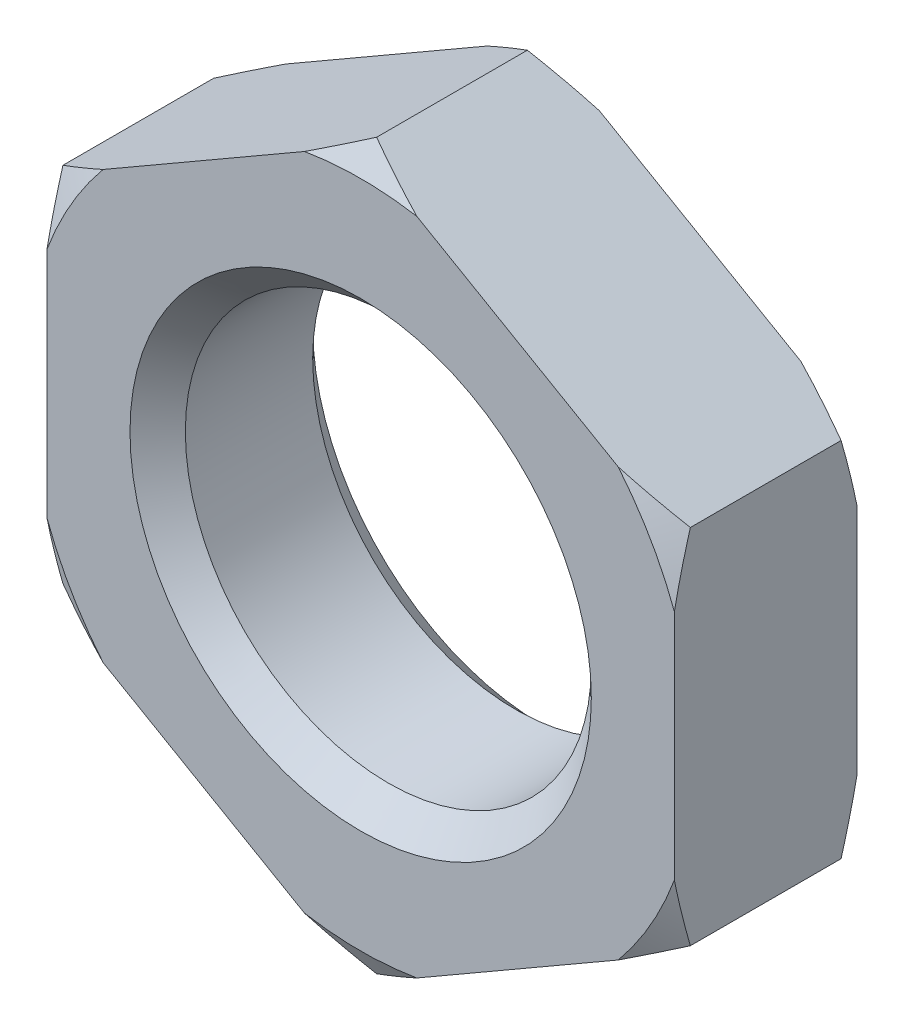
ISO-10303-21;
HEADER;
FILE_DESCRIPTION(('STEP AP214'),'2;1');
FILE_NAME('part.step','',(''),(''),'','','');
FILE_SCHEMA(('AUTOMOTIVE_DESIGN { 1 0 10303 214 1 1 1 1 }'));
ENDSEC;
DATA;
#1=APPLICATION_CONTEXT('core data for automotive mechanical design processes');
#2=APPLICATION_PROTOCOL_DEFINITION('international standard','automotive_design',2000,#1);
#3=PRODUCT_CONTEXT('',#1,'mechanical');
#4=PRODUCT('Part','Part','',(#3));
#5=PRODUCT_RELATED_PRODUCT_CATEGORY('part','',(#4));
#6=PRODUCT_DEFINITION_FORMATION('','',#4);
#7=PRODUCT_DEFINITION_CONTEXT('part definition',#1,'design');
#8=PRODUCT_DEFINITION('design','',#6,#7);
#9=PRODUCT_DEFINITION_SHAPE('','',#8);
#10=(LENGTH_UNIT() NAMED_UNIT(*) SI_UNIT(.MILLI.,.METRE.));
#11=(NAMED_UNIT(*) PLANE_ANGLE_UNIT() SI_UNIT($,.RADIAN.));
#12=(NAMED_UNIT(*) SI_UNIT($,.STERADIAN.) SOLID_ANGLE_UNIT());
#13=UNCERTAINTY_MEASURE_WITH_UNIT(LENGTH_MEASURE(1.E-05),#10,'distance_accuracy_value','');
#14=(GEOMETRIC_REPRESENTATION_CONTEXT(3) GLOBAL_UNCERTAINTY_ASSIGNED_CONTEXT((#13)) GLOBAL_UNIT_ASSIGNED_CONTEXT((#10,
#11,#12)) REPRESENTATION_CONTEXT('',''));
#15=CARTESIAN_POINT('',(0.,0.,0.));
#16=DIRECTION('',(0.,0.,1.));
#17=DIRECTION('',(1.,0.,0.));
#18=AXIS2_PLACEMENT_3D('',#15,#16,#17);
#19=CARTESIAN_POINT('',(0.,0.,-4.95));
#20=DIRECTION('',(0.,0.,1.));
#21=DIRECTION('',(1.,0.,0.));
#22=AXIS2_PLACEMENT_3D('',#19,#20,#21);
#23=PLANE('',#22);
#24=CARTESIAN_POINT('',(0.,0.,-4.95));
#25=DIRECTION('',(0.,0.,1.));
#26=DIRECTION('',(1.,0.,0.));
#27=AXIS2_PLACEMENT_3D('',#24,#25,#26);
#28=CIRCLE('',#27,12.5);
#29=CARTESIAN_POINT('',(12.5,0.,-4.95));
#30=VERTEX_POINT('',#29);
#31=EDGE_CURVE('E427',#30,#30,#28,.T.);
#32=ORIENTED_EDGE('',*,*,#31,.T.);
#33=EDGE_LOOP('',(#32));
#34=FACE_BOUND('',#33,.T.);
#35=DIRECTION('',(0.,1.,0.));
#36=VECTOR('',#35,1.);
#37=CARTESIAN_POINT('',(17.,-9.81495457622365,-4.95));
#38=LINE('',#37,#36);
#39=CARTESIAN_POINT('',(17.,-6.30028617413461,-4.95));
#40=VERTEX_POINT('',#39);
#41=CARTESIAN_POINT('',(17.,6.30028617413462,-4.95));
#42=VERTEX_POINT('',#41);
#43=EDGE_CURVE('E361',#40,#42,#38,.T.);
#44=ORIENTED_EDGE('',*,*,#43,.F.);
#45=CARTESIAN_POINT('',(0.,0.,-4.95));
#46=DIRECTION('',(0.,0.,-1.));
#47=DIRECTION('',(-1.,0.,0.));
#48=AXIS2_PLACEMENT_3D('',#45,#46,#47);
#49=CIRCLE('',#48,18.1299091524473);
#50=CARTESIAN_POINT('',(13.9562078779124,-11.5722887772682,-4.95));
#51=VERTEX_POINT('',#50);
#52=EDGE_CURVE('E349',#40,#51,#49,.T.);
#53=ORIENTED_EDGE('',*,*,#52,.T.);
#54=DIRECTION('',(0.866025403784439,0.5,0.));
#55=VECTOR('',#54,1.);
#56=CARTESIAN_POINT('',(0.,-19.6299091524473,-4.95));
#57=LINE('',#56,#55);
#58=CARTESIAN_POINT('',(3.04379212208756,-17.8725749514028,-4.95));
#59=VERTEX_POINT('',#58);
#60=EDGE_CURVE('E372',#59,#51,#57,.T.);
#61=ORIENTED_EDGE('',*,*,#60,.F.);
#62=CARTESIAN_POINT('',(-3.04379212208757,-17.8725749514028,-4.95));
#63=VERTEX_POINT('',#62);
#64=EDGE_CURVE('E344',#59,#63,#49,.T.);
#65=ORIENTED_EDGE('',*,*,#64,.T.);
#66=DIRECTION('',(0.866025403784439,-0.5,0.));
#67=VECTOR('',#66,1.);
#68=CARTESIAN_POINT('',(-17.,-9.81495457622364,-4.95));
#69=LINE('',#68,#67);
#70=CARTESIAN_POINT('',(-13.9562078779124,-11.5722887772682,-4.95));
#71=VERTEX_POINT('',#70);
#72=EDGE_CURVE('E378',#71,#63,#69,.T.);
#73=ORIENTED_EDGE('',*,*,#72,.F.);
#74=CARTESIAN_POINT('',(-17.,-6.3002861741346,-4.95));
#75=VERTEX_POINT('',#74);
#76=EDGE_CURVE('E338',#71,#75,#49,.T.);
#77=ORIENTED_EDGE('',*,*,#76,.T.);
#78=DIRECTION('',(0.,-1.,0.));
#79=VECTOR('',#78,1.);
#80=CARTESIAN_POINT('',(-17.,9.81495457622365,-4.95));
#81=LINE('',#80,#79);
#82=CARTESIAN_POINT('',(-17.,6.3002861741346,-4.95));
#83=VERTEX_POINT('',#82);
#84=EDGE_CURVE('E477',#83,#75,#81,.T.);
#85=ORIENTED_EDGE('',*,*,#84,.F.);
#86=CARTESIAN_POINT('',(-13.9562078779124,11.5722887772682,-4.95));
#87=VERTEX_POINT('',#86);
#88=EDGE_CURVE('E63',#83,#87,#49,.T.);
#89=ORIENTED_EDGE('',*,*,#88,.T.);
#90=DIRECTION('',(-0.866025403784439,-0.5,0.));
#91=VECTOR('',#90,1.);
#92=CARTESIAN_POINT('',(0.,19.6299091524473,-4.95));
#93=LINE('',#92,#91);
#94=CARTESIAN_POINT('',(-3.04379212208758,17.8725749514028,-4.95));
#95=VERTEX_POINT('',#94);
#96=EDGE_CURVE('E181',#95,#87,#93,.T.);
#97=ORIENTED_EDGE('',*,*,#96,.F.);
#98=CARTESIAN_POINT('',(3.04379212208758,17.8725749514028,-4.95));
#99=VERTEX_POINT('',#98);
#100=EDGE_CURVE('E55',#95,#99,#49,.T.);
#101=ORIENTED_EDGE('',*,*,#100,.T.);
#102=DIRECTION('',(-0.866025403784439,0.5,0.));
#103=VECTOR('',#102,1.);
#104=CARTESIAN_POINT('',(17.,9.81495457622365,-4.95));
#105=LINE('',#104,#103);
#106=CARTESIAN_POINT('',(13.9562078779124,11.5722887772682,-4.95));
#107=VERTEX_POINT('',#106);
#108=EDGE_CURVE('E362',#107,#99,#105,.T.);
#109=ORIENTED_EDGE('',*,*,#108,.F.);
#110=EDGE_CURVE('E342',#107,#42,#49,.T.);
#111=ORIENTED_EDGE('',*,*,#110,.T.);
#112=EDGE_LOOP('',(#44,#53,#61,#65,#73,#77,#85,#89,#97,#101,#109,#111));
#113=FACE_BOUND('',#112,.T.);
#114=ADVANCED_FACE('F39',(#34,#113),#23,.F.);
#115=CARTESIAN_POINT('',(0.,0.,4.95));
#116=DIRECTION('',(0.,0.,1.));
#117=DIRECTION('',(1.,0.,0.));
#118=AXIS2_PLACEMENT_3D('',#115,#116,#117);
#119=PLANE('',#118);
#120=CARTESIAN_POINT('',(0.,0.,4.95));
#121=DIRECTION('',(0.,0.,1.));
#122=DIRECTION('',(1.,0.,0.));
#123=AXIS2_PLACEMENT_3D('',#120,#121,#122);
#124=CIRCLE('',#123,12.5);
#125=CARTESIAN_POINT('',(12.5,0.,4.95));
#126=VERTEX_POINT('',#125);
#127=EDGE_CURVE('E11',#126,#126,#124,.F.);
#128=ORIENTED_EDGE('',*,*,#127,.T.);
#129=EDGE_LOOP('',(#128));
#130=FACE_BOUND('',#129,.T.);
#131=CARTESIAN_POINT('',(0.,0.,4.95));
#132=DIRECTION('',(0.,0.,-1.));
#133=DIRECTION('',(-1.,0.,0.));
#134=AXIS2_PLACEMENT_3D('',#131,#132,#133);
#135=CIRCLE('',#134,18.1299091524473);
#136=CARTESIAN_POINT('',(17.,-6.30028617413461,4.95));
#137=VERTEX_POINT('',#136);
#138=CARTESIAN_POINT('',(13.9562078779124,-11.5722887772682,4.95));
#139=VERTEX_POINT('',#138);
#140=EDGE_CURVE('E315',#137,#139,#135,.T.);
#141=ORIENTED_EDGE('',*,*,#140,.F.);
#142=DIRECTION('',(0.,1.,0.));
#143=VECTOR('',#142,1.);
#144=CARTESIAN_POINT('',(17.,-9.81495457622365,4.95));
#145=LINE('',#144,#143);
#146=CARTESIAN_POINT('',(17.,6.30028617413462,4.95));
#147=VERTEX_POINT('',#146);
#148=EDGE_CURVE('E386',#137,#147,#145,.T.);
#149=ORIENTED_EDGE('',*,*,#148,.T.);
#150=CARTESIAN_POINT('',(13.9562078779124,11.5722887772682,4.95));
#151=VERTEX_POINT('',#150);
#152=EDGE_CURVE('E306',#151,#147,#135,.T.);
#153=ORIENTED_EDGE('',*,*,#152,.F.);
#154=DIRECTION('',(-0.866025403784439,0.5,0.));
#155=VECTOR('',#154,1.);
#156=CARTESIAN_POINT('',(17.,9.81495457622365,4.95));
#157=LINE('',#156,#155);
#158=CARTESIAN_POINT('',(3.04379212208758,17.8725749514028,4.95));
#159=VERTEX_POINT('',#158);
#160=EDGE_CURVE('E371',#151,#159,#157,.T.);
#161=ORIENTED_EDGE('',*,*,#160,.T.);
#162=CARTESIAN_POINT('',(-3.04379212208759,17.8725749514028,4.95));
#163=VERTEX_POINT('',#162);
#164=EDGE_CURVE('E296',#163,#159,#135,.T.);
#165=ORIENTED_EDGE('',*,*,#164,.F.);
#166=DIRECTION('',(-0.866025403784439,-0.5,0.));
#167=VECTOR('',#166,1.);
#168=CARTESIAN_POINT('',(0.,19.6299091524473,4.95));
#169=LINE('',#168,#167);
#170=CARTESIAN_POINT('',(-13.9562078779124,11.5722887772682,4.95));
#171=VERTEX_POINT('',#170);
#172=EDGE_CURVE('E376',#163,#171,#169,.T.);
#173=ORIENTED_EDGE('',*,*,#172,.T.);
#174=CARTESIAN_POINT('',(-17.,6.3002861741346,4.95));
#175=VERTEX_POINT('',#174);
#176=EDGE_CURVE('E294',#175,#171,#135,.T.);
#177=ORIENTED_EDGE('',*,*,#176,.F.);
#178=DIRECTION('',(0.,-1.,0.));
#179=VECTOR('',#178,1.);
#180=CARTESIAN_POINT('',(-17.,9.81495457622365,4.95));
#181=LINE('',#180,#179);
#182=CARTESIAN_POINT('',(-17.,-6.3002861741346,4.95));
#183=VERTEX_POINT('',#182);
#184=EDGE_CURVE('E493',#175,#183,#181,.T.);
#185=ORIENTED_EDGE('',*,*,#184,.T.);
#186=CARTESIAN_POINT('',(-13.9562078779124,-11.5722887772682,4.95));
#187=VERTEX_POINT('',#186);
#188=EDGE_CURVE('E297',#187,#183,#135,.T.);
#189=ORIENTED_EDGE('',*,*,#188,.F.);
#190=DIRECTION('',(0.866025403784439,-0.5,0.));
#191=VECTOR('',#190,1.);
#192=CARTESIAN_POINT('',(-17.,-9.81495457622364,4.95));
#193=LINE('',#192,#191);
#194=CARTESIAN_POINT('',(-3.04379212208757,-17.8725749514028,4.95));
#195=VERTEX_POINT('',#194);
#196=EDGE_CURVE('E469',#187,#195,#193,.T.);
#197=ORIENTED_EDGE('',*,*,#196,.T.);
#198=CARTESIAN_POINT('',(3.04379212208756,-17.8725749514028,4.95));
#199=VERTEX_POINT('',#198);
#200=EDGE_CURVE('E308',#199,#195,#135,.T.);
#201=ORIENTED_EDGE('',*,*,#200,.F.);
#202=DIRECTION('',(0.866025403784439,0.5,0.));
#203=VECTOR('',#202,1.);
#204=CARTESIAN_POINT('',(0.,-19.6299091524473,4.95));
#205=LINE('',#204,#203);
#206=EDGE_CURVE('E466',#199,#139,#205,.T.);
#207=ORIENTED_EDGE('',*,*,#206,.T.);
#208=EDGE_LOOP('',(#141,#149,#153,#161,#165,#173,#177,#185,#189,#197,#201,#207));
#209=FACE_BOUND('',#208,.T.);
#210=ADVANCED_FACE('F418',(#130,#209),#119,.T.);
#211=CARTESIAN_POINT('',(17.,9.81495457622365,4.95));
#212=DIRECTION('',(-0.5,-0.866025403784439,0.));
#213=DIRECTION('',(0.866025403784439,-0.5,0.));
#214=AXIS2_PLACEMENT_3D('',#211,#212,#213);
#215=PLANE('',#214);
#216=DIRECTION('',(0.,0.,-1.));
#217=VECTOR('',#216,1.);
#218=CARTESIAN_POINT('',(17.,9.81495457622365,4.95));
#219=LINE('',#218,#217);
#220=CARTESIAN_POINT('',(17.,9.81495457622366,4.08397459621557));
#221=VERTEX_POINT('',#220);
#222=CARTESIAN_POINT('',(17.,9.81495457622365,-4.08397459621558));
#223=VERTEX_POINT('',#222);
#224=EDGE_CURVE('E382',#221,#223,#219,.T.);
#225=ORIENTED_EDGE('',*,*,#224,.T.);
#226=CARTESIAN_POINT('',(28.7896020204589,3.00822467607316,1.29486926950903));
#227=CARTESIAN_POINT('',(28.5225892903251,3.16238454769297,1.15079620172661));
#228=CARTESIAN_POINT('',(28.2552526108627,3.31673145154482,1.00752418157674));
#229=CARTESIAN_POINT('',(27.7198745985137,3.62583209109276,0.722739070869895));
#230=CARTESIAN_POINT('',(27.4518332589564,3.7805858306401,0.581225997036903));
#231=CARTESIAN_POINT('',(26.6465119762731,4.24553828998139,0.15953167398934));
#232=CARTESIAN_POINT('',(26.1080971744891,4.55639222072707,-0.117770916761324));
#233=CARTESIAN_POINT('',(25.0260248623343,5.18112696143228,-0.664015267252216));
#234=CARTESIAN_POINT('',(24.4823560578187,5.49501429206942,-0.932927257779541));
#235=CARTESIAN_POINT('',(23.3909413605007,6.12514286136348,-1.45946261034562));
#236=CARTESIAN_POINT('',(22.843195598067,6.44138402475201,-1.71708633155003));
#237=CARTESIAN_POINT('',(21.7290366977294,7.08464396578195,-2.22492098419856));
#238=CARTESIAN_POINT('',(21.1625022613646,7.41173277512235,-2.4747786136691));
#239=CARTESIAN_POINT('',(20.0237095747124,8.06921503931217,-2.95666296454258));
#240=CARTESIAN_POINT('',(19.4514510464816,8.3996086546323,-3.18868881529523));
#241=CARTESIAN_POINT('',(18.3011062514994,9.06376053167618,-3.63048169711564));
#242=CARTESIAN_POINT('',(17.7230262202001,9.39751519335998,-3.8402702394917));
#243=CARTESIAN_POINT('',(16.5600005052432,10.0689884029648,-4.23275015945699));
#244=CARTESIAN_POINT('',(15.9750557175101,10.4067064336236,-4.41544503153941));
#245=CARTESIAN_POINT('',(14.9813690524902,10.9804116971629,-4.69612445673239));
#246=CARTESIAN_POINT('',(14.5744628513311,11.2153391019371,-4.80277448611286));
#247=CARTESIAN_POINT('',(13.7574873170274,11.6870201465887,-4.99839610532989));
#248=CARTESIAN_POINT('',(13.3474182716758,11.9237736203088,-5.08736928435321));
#249=CARTESIAN_POINT('',(12.524516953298,12.3988759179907,-5.24563434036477));
#250=CARTESIAN_POINT('',(12.1116853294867,12.6372243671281,-5.31493068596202));
#251=CARTESIAN_POINT('',(11.2837296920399,13.115244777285,-5.43208442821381));
#252=CARTESIAN_POINT('',(10.8686056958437,13.354916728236,-5.47994198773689));
#253=CARTESIAN_POINT('',(10.0416632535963,13.8323521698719,-5.55242731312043));
#254=CARTESIAN_POINT('',(9.62986221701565,14.0701056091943,-5.57731773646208));
#255=CARTESIAN_POINT('',(8.80570092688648,14.545935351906,-5.60407286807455));
#256=CARTESIAN_POINT('',(8.39334068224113,14.7840116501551,-5.60593793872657));
#257=CARTESIAN_POINT('',(7.56900625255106,15.259941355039,-5.58658339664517));
#258=CARTESIAN_POINT('',(7.15703208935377,15.4977947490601,-5.56536254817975));
#259=CARTESIAN_POINT('',(6.33441412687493,15.9727334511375,-5.5004793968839));
#260=CARTESIAN_POINT('',(5.92377038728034,16.2098187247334,-5.45681610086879));
#261=CARTESIAN_POINT('',(4.95311411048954,16.7702273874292,-5.32818754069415));
#262=CARTESIAN_POINT('',(4.39401903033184,17.0930210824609,-5.23391998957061));
#263=CARTESIAN_POINT('',(3.28118095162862,17.7355184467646,-5.00995474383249));
#264=CARTESIAN_POINT('',(2.72743886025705,18.0552215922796,-4.88025114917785));
#265=CARTESIAN_POINT('',(1.62544849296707,18.6914560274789,-4.59032994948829));
#266=CARTESIAN_POINT('',(1.07720637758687,19.0079837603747,-4.43008144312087));
#267=CARTESIAN_POINT('',(-0.0131371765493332,19.6374939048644,-4.08410142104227));
#268=CARTESIAN_POINT('',(-0.555238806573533,19.950476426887,-3.89837070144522));
#269=CARTESIAN_POINT('',(-1.63989985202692,20.5767057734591,-3.50356787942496));
#270=CARTESIAN_POINT('',(-2.18239175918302,20.8899136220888,-3.29425020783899));
#271=CARTESIAN_POINT('',(-3.26199084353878,21.5132204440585,-2.85793545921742));
#272=CARTESIAN_POINT('',(-3.79909797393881,21.8233193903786,-2.63093822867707));
#273=CARTESIAN_POINT('',(-4.86824906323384,22.4405940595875,-2.1625758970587));
#274=CARTESIAN_POINT('',(-5.40029553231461,22.7477712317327,-1.92121840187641));
#275=CARTESIAN_POINT('',(-6.46019883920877,23.359706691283,-1.4266076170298));
#276=CARTESIAN_POINT('',(-6.98805576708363,23.6644650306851,-1.17335458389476));
#277=CARTESIAN_POINT('',(-7.87526558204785,24.1766958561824,-0.737924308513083));
#278=CARTESIAN_POINT('',(-8.23557971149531,24.3847233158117,-0.558347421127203));
#279=CARTESIAN_POINT('',(-8.95464581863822,24.7998763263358,-0.195107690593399));
#280=CARTESIAN_POINT('',(-9.31339784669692,25.0070019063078,-0.0114449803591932));
#281=CARTESIAN_POINT('',(-10.0257611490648,25.4182850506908,0.3575530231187));
#282=CARTESIAN_POINT('',(-10.3793869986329,25.6224510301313,0.542850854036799));
#283=CARTESIAN_POINT('',(-11.0853963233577,26.0300657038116,0.9165957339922));
#284=CARTESIAN_POINT('',(-11.4377797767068,26.2335143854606,1.10504283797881));
#285=CARTESIAN_POINT('',(-11.7896020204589,26.4366390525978,1.29486926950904));
#286=B_SPLINE_CURVE_WITH_KNOTS('',3,(#226,#227,#228,#229,#230,#231,#232,#233,#234,#235,#236,
#237,#238,#239,#240,#241,#242,#243,#244,#245,#246,#247,#248,#249,#250,#251,#252,#253,#254,#255,
#256,#257,#258,#259,#260,#261,#262,#263,#264,#265,#266,#267,#268,#269,#270,#271,#272,#273,#274,
#275,#276,#277,#278,#279,#280,#281,#282,#283,#284,#285),.UNSPECIFIED.,.F.,.F.,(4,2,2,2,2,2,2,2,
2,2,2,2,2,2,2,2,2,2,2,2,2,2,2,2,2,2,2,2,2,4),(0.,1.02095966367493,2.04192902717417,
4.08410646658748,6.13285411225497,8.18153652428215,10.2821363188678,12.3828386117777,
14.4814898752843,16.5798702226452,18.0250025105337,19.4700048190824,20.9146787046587,
22.3593416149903,23.7872704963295,25.2151769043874,26.6431597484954,28.0712057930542,
30.0273216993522,31.9837634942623,33.9421951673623,35.9005656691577,37.8816327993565,
39.8627171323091,41.8427613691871,43.8227629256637,45.1822070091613,46.5416069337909,
47.8868190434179,49.2320546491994),.UNSPECIFIED.);
#287=EDGE_CURVE('E319',#223,#107,#286,.T.);
#288=ORIENTED_EDGE('',*,*,#287,.T.);
#289=ORIENTED_EDGE('',*,*,#108,.T.);
#290=CARTESIAN_POINT('',(0.,19.6299091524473,-4.08397459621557));
#291=VERTEX_POINT('',#290);
#292=EDGE_CURVE('E309',#99,#291,#286,.T.);
#293=ORIENTED_EDGE('',*,*,#292,.T.);
#294=DIRECTION('',(0.,0.,-1.));
#295=VECTOR('',#294,1.);
#296=CARTESIAN_POINT('',(0.,19.6299091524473,4.95));
#297=LINE('',#296,#295);
#298=CARTESIAN_POINT('',(0.,19.6299091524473,4.08397459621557));
#299=VERTEX_POINT('',#298);
#300=EDGE_CURVE('E190',#299,#291,#297,.T.);
#301=ORIENTED_EDGE('',*,*,#300,.F.);
#302=CARTESIAN_POINT('',(-11.7896020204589,26.4366390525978,-1.29486926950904));
#303=CARTESIAN_POINT('',(-11.5225892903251,26.282479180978,-1.15079620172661));
#304=CARTESIAN_POINT('',(-11.2552526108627,26.1281322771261,-1.00752418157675));
#305=CARTESIAN_POINT('',(-10.7198745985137,25.8190316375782,-0.722739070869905));
#306=CARTESIAN_POINT('',(-10.4518332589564,25.6642778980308,-0.581225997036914));
#307=CARTESIAN_POINT('',(-9.64651197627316,25.1993254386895,-0.159531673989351));
#308=CARTESIAN_POINT('',(-9.10809717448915,24.8884715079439,0.117770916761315));
#309=CARTESIAN_POINT('',(-8.02602486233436,24.2637367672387,0.664015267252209));
#310=CARTESIAN_POINT('',(-7.48235605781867,23.9498494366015,0.932927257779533));
#311=CARTESIAN_POINT('',(-6.39094136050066,23.3197208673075,1.45946261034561));
#312=CARTESIAN_POINT('',(-5.84319559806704,23.0034797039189,1.71708633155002));
#313=CARTESIAN_POINT('',(-4.72903669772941,22.360219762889,2.22492098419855));
#314=CARTESIAN_POINT('',(-4.16250226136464,22.0331309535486,2.47477861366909));
#315=CARTESIAN_POINT('',(-3.02370957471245,21.3756486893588,2.95666296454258));
#316=CARTESIAN_POINT('',(-2.45145104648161,21.0452550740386,3.18868881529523));
#317=CARTESIAN_POINT('',(-1.30110625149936,20.3811031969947,3.63048169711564));
#318=CARTESIAN_POINT('',(-0.723026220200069,20.047348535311,3.8402702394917));
#319=CARTESIAN_POINT('',(0.439999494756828,19.3758753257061,4.23275015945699));
#320=CARTESIAN_POINT('',(1.02494428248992,19.0381572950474,4.41544503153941));
#321=CARTESIAN_POINT('',(2.01863094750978,18.464452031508,4.69612445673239));
#322=CARTESIAN_POINT('',(2.42553714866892,18.2295246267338,4.80277448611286));
#323=CARTESIAN_POINT('',(3.24251268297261,17.7578435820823,4.99839610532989));
#324=CARTESIAN_POINT('',(3.65258172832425,17.5210901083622,5.08736928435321));
#325=CARTESIAN_POINT('',(4.475483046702,17.0459878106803,5.24563434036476));
#326=CARTESIAN_POINT('',(4.8883146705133,16.8076393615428,5.31493068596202));
#327=CARTESIAN_POINT('',(5.71627030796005,16.3296189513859,5.43208442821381));
#328=CARTESIAN_POINT('',(6.13139430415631,16.0899470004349,5.47994198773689));
#329=CARTESIAN_POINT('',(6.9583367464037,15.612511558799,5.55242731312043));
#330=CARTESIAN_POINT('',(7.37013778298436,15.3747581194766,5.57731773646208));
#331=CARTESIAN_POINT('',(8.19429907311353,14.8989283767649,5.60407286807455));
#332=CARTESIAN_POINT('',(8.60665931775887,14.6608520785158,5.60593793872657));
#333=CARTESIAN_POINT('',(9.43099374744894,14.184922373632,5.58658339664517));
#334=CARTESIAN_POINT('',(9.84296791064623,13.9470689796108,5.56536254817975));
#335=CARTESIAN_POINT('',(10.6655858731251,13.4721302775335,5.5004793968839));
#336=CARTESIAN_POINT('',(11.0762296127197,13.2350450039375,5.45681610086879));
#337=CARTESIAN_POINT('',(12.0468858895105,12.6746363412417,5.32818754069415));
#338=CARTESIAN_POINT('',(12.6059809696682,12.3518426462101,5.23391998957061));
#339=CARTESIAN_POINT('',(13.7188190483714,11.7093452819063,5.0099547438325));
#340=CARTESIAN_POINT('',(14.272561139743,11.3896421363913,4.88025114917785));
#341=CARTESIAN_POINT('',(15.3745515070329,10.7534077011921,4.5903299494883));
#342=CARTESIAN_POINT('',(15.9227936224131,10.4368799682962,4.43008144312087));
#343=CARTESIAN_POINT('',(17.0131371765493,9.8073698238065,4.08410142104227));
#344=CARTESIAN_POINT('',(17.5552388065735,9.49438730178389,3.89837070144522));
#345=CARTESIAN_POINT('',(18.6398998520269,8.86815795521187,3.50356787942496));
#346=CARTESIAN_POINT('',(19.182391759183,8.5549501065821,3.29425020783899));
#347=CARTESIAN_POINT('',(20.2619908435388,7.93164328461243,2.85793545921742));
#348=CARTESIAN_POINT('',(20.7990979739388,7.62154433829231,2.63093822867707));
#349=CARTESIAN_POINT('',(21.8682490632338,7.00426966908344,2.16257589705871));
#350=CARTESIAN_POINT('',(22.4002955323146,6.69709249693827,1.92121840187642));
#351=CARTESIAN_POINT('',(23.4601988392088,6.08515703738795,1.42660761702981));
#352=CARTESIAN_POINT('',(23.9880557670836,5.78039869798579,1.17335458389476));
#353=CARTESIAN_POINT('',(24.8752655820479,5.26816787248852,0.73792430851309));
#354=CARTESIAN_POINT('',(25.2355797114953,5.06014041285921,0.558347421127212));
#355=CARTESIAN_POINT('',(25.9546458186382,4.64498740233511,0.195107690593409));
#356=CARTESIAN_POINT('',(26.3133978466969,4.4378618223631,0.0114449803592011));
#357=CARTESIAN_POINT('',(27.0257611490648,4.02657867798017,-0.357553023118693));
#358=CARTESIAN_POINT('',(27.3793869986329,3.82241269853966,-0.542850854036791));
#359=CARTESIAN_POINT('',(28.0853963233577,3.41479802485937,-0.91659573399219));
#360=CARTESIAN_POINT('',(28.4377797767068,3.21134934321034,-1.10504283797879));
#361=CARTESIAN_POINT('',(28.7896020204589,3.00822467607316,-1.29486926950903));
#362=B_SPLINE_CURVE_WITH_KNOTS('',3,(#302,#303,#304,#305,#306,#307,#308,#309,#310,#311,#312,
#313,#314,#315,#316,#317,#318,#319,#320,#321,#322,#323,#324,#325,#326,#327,#328,#329,#330,#331,
#332,#333,#334,#335,#336,#337,#338,#339,#340,#341,#342,#343,#344,#345,#346,#347,#348,#349,#350,
#351,#352,#353,#354,#355,#356,#357,#358,#359,#360,#361),.UNSPECIFIED.,.F.,.F.,(4,2,2,2,2,2,2,2,
2,2,2,2,2,2,2,2,2,2,2,2,2,2,2,2,2,2,2,2,2,4),(0.,1.02095966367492,2.04192902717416,
4.08410646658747,6.13285411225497,8.18153652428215,10.2821363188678,12.3828386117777,
14.4814898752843,16.5798702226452,18.0250025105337,19.4700048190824,20.9146787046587,
22.3593416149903,23.7872704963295,25.2151769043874,26.6431597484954,28.0712057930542,
30.0273216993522,31.9837634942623,33.9421951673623,35.9005656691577,37.8816327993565,
39.8627171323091,41.8427613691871,43.8227629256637,45.1822070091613,46.5416069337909,
47.8868190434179,49.2320546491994),.UNSPECIFIED.);
#363=EDGE_CURVE('E474',#299,#159,#362,.T.);
#364=ORIENTED_EDGE('',*,*,#363,.T.);
#365=ORIENTED_EDGE('',*,*,#160,.F.);
#366=EDGE_CURVE('E247',#151,#221,#362,.T.);
#367=ORIENTED_EDGE('',*,*,#366,.T.);
#368=EDGE_LOOP('',(#225,#288,#289,#293,#301,#364,#365,#367));
#369=FACE_BOUND('',#368,.T.);
#370=ADVANCED_FACE('F423',(#369),#215,.F.);
#371=CARTESIAN_POINT('',(0.,19.6299091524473,4.95));
#372=DIRECTION('',(0.5,-0.866025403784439,0.));
#373=DIRECTION('',(0.866025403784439,0.5,0.));
#374=AXIS2_PLACEMENT_3D('',#371,#372,#373);
#375=PLANE('',#374);
#376=ORIENTED_EDGE('',*,*,#300,.T.);
#377=CARTESIAN_POINT('',(11.7896020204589,26.4366390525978,1.29486926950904));
#378=CARTESIAN_POINT('',(11.5225892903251,26.282479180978,1.15079620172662));
#379=CARTESIAN_POINT('',(11.2552526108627,26.1281322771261,1.00752418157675));
#380=CARTESIAN_POINT('',(10.7198745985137,25.8190316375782,0.722739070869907));
#381=CARTESIAN_POINT('',(10.4518332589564,25.6642778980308,0.581225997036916));
#382=CARTESIAN_POINT('',(9.64651197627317,25.1993254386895,0.159531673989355));
#383=CARTESIAN_POINT('',(9.10809717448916,24.8884715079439,-0.117770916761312));
#384=CARTESIAN_POINT('',(8.02602486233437,24.2637367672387,-0.664015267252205));
#385=CARTESIAN_POINT('',(7.48235605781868,23.9498494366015,-0.932927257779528));
#386=CARTESIAN_POINT('',(6.39094136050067,23.3197208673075,-1.45946261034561));
#387=CARTESIAN_POINT('',(5.84319559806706,23.0034797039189,-1.71708633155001));
#388=CARTESIAN_POINT('',(4.72903669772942,22.360219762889,-2.22492098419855));
#389=CARTESIAN_POINT('',(4.16250226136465,22.0331309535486,-2.47477861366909));
#390=CARTESIAN_POINT('',(3.02370957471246,21.3756486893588,-2.95666296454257));
#391=CARTESIAN_POINT('',(2.45145104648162,21.0452550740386,-3.18868881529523));
#392=CARTESIAN_POINT('',(1.30110625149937,20.3811031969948,-3.63048169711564));
#393=CARTESIAN_POINT('',(0.723026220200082,20.047348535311,-3.8402702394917));
#394=CARTESIAN_POINT('',(-0.439999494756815,19.3758753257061,-4.23275015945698));
#395=CARTESIAN_POINT('',(-1.02494428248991,19.0381572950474,-4.4154450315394));
#396=CARTESIAN_POINT('',(-2.01863094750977,18.464452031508,-4.69612445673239));
#397=CARTESIAN_POINT('',(-2.4255371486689,18.2295246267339,-4.80277448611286));
#398=CARTESIAN_POINT('',(-3.24251268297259,17.7578435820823,-4.99839610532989));
#399=CARTESIAN_POINT('',(-3.65258172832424,17.5210901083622,-5.08736928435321));
#400=CARTESIAN_POINT('',(-4.47548304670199,17.0459878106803,-5.24563434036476));
#401=CARTESIAN_POINT('',(-4.88831467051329,16.8076393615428,-5.31493068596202));
#402=CARTESIAN_POINT('',(-5.71627030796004,16.3296189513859,-5.43208442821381));
#403=CARTESIAN_POINT('',(-6.1313943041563,16.0899470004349,-5.47994198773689));
#404=CARTESIAN_POINT('',(-6.95833674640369,15.612511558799,-5.55242731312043));
#405=CARTESIAN_POINT('',(-7.37013778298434,15.3747581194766,-5.57731773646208));
#406=CARTESIAN_POINT('',(-8.19429907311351,14.8989283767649,-5.60407286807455));
#407=CARTESIAN_POINT('',(-8.60665931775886,14.6608520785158,-5.60593793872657));
#408=CARTESIAN_POINT('',(-9.43099374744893,14.184922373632,-5.58658339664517));
#409=CARTESIAN_POINT('',(-9.84296791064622,13.9470689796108,-5.56536254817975));
#410=CARTESIAN_POINT('',(-10.6655858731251,13.4721302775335,-5.5004793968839));
#411=CARTESIAN_POINT('',(-11.0762296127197,13.2350450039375,-5.45681610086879));
#412=CARTESIAN_POINT('',(-12.0468858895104,12.6746363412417,-5.32818754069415));
#413=CARTESIAN_POINT('',(-12.6059809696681,12.3518426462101,-5.23391998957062));
#414=CARTESIAN_POINT('',(-13.7188190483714,11.7093452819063,-5.0099547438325));
#415=CARTESIAN_POINT('',(-14.2725611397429,11.3896421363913,-4.88025114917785));
#416=CARTESIAN_POINT('',(-15.3745515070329,10.7534077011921,-4.5903299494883));
#417=CARTESIAN_POINT('',(-15.9227936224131,10.4368799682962,-4.43008144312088));
#418=CARTESIAN_POINT('',(-17.0131371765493,9.80736982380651,-4.08410142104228));
#419=CARTESIAN_POINT('',(-17.5552388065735,9.4943873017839,-3.89837070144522));
#420=CARTESIAN_POINT('',(-18.6398998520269,8.86815795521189,-3.50356787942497));
#421=CARTESIAN_POINT('',(-19.182391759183,8.55495010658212,-3.294250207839));
#422=CARTESIAN_POINT('',(-20.2619908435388,7.93164328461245,-2.85793545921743));
#423=CARTESIAN_POINT('',(-20.7990979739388,7.62154433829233,-2.63093822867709));
#424=CARTESIAN_POINT('',(-21.8682490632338,7.00426966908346,-2.16257589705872));
#425=CARTESIAN_POINT('',(-22.4002955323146,6.69709249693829,-1.92121840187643));
#426=CARTESIAN_POINT('',(-23.4601988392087,6.08515703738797,-1.42660761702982));
#427=CARTESIAN_POINT('',(-23.9880557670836,5.78039869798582,-1.17335458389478));
#428=CARTESIAN_POINT('',(-24.8752655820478,5.26816787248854,-0.737924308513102));
#429=CARTESIAN_POINT('',(-25.2355797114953,5.06014041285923,-0.55834742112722));
#430=CARTESIAN_POINT('',(-25.9546458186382,4.64498740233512,-0.195107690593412));
#431=CARTESIAN_POINT('',(-26.3133978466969,4.43786182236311,-0.0114449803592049));
#432=CARTESIAN_POINT('',(-27.0257611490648,4.02657867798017,0.357553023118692));
#433=CARTESIAN_POINT('',(-27.3793869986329,3.82241269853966,0.542850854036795));
#434=CARTESIAN_POINT('',(-28.0853963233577,3.41479802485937,0.9165957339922));
#435=CARTESIAN_POINT('',(-28.4377797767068,3.21134934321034,1.10504283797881));
#436=CARTESIAN_POINT('',(-28.7896020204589,3.00822467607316,1.29486926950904));
#437=B_SPLINE_CURVE_WITH_KNOTS('',3,(#377,#378,#379,#380,#381,#382,#383,#384,#385,#386,#387,
#388,#389,#390,#391,#392,#393,#394,#395,#396,#397,#398,#399,#400,#401,#402,#403,#404,#405,#406,
#407,#408,#409,#410,#411,#412,#413,#414,#415,#416,#417,#418,#419,#420,#421,#422,#423,#424,#425,
#426,#427,#428,#429,#430,#431,#432,#433,#434,#435,#436),.UNSPECIFIED.,.F.,.F.,(4,2,2,2,2,2,2,2,
2,2,2,2,2,2,2,2,2,2,2,2,2,2,2,2,2,2,2,2,2,4),(0.,1.02095966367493,2.04192902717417,
4.08410646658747,6.13285411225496,8.18153652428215,10.2821363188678,12.3828386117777,
14.4814898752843,16.5798702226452,18.0250025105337,19.4700048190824,20.9146787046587,
22.3593416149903,23.7872704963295,25.2151769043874,26.6431597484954,28.0712057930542,
30.0273216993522,31.9837634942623,33.9421951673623,35.9005656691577,37.8816327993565,
39.8627171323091,41.8427613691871,43.8227629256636,45.1822070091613,46.5416069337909,
47.8868190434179,49.2320546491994),.UNSPECIFIED.);
#438=EDGE_CURVE('E183',#291,#95,#437,.T.);
#439=ORIENTED_EDGE('',*,*,#438,.T.);
#440=ORIENTED_EDGE('',*,*,#96,.T.);
#441=CARTESIAN_POINT('',(-17.,9.81495457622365,-4.08397459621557));
#442=VERTEX_POINT('',#441);
#443=EDGE_CURVE('E165',#87,#442,#437,.T.);
#444=ORIENTED_EDGE('',*,*,#443,.T.);
#445=DIRECTION('',(0.,0.,-1.));
#446=VECTOR('',#445,1.);
#447=CARTESIAN_POINT('',(-17.,9.81495457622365,4.95));
#448=LINE('',#447,#446);
#449=CARTESIAN_POINT('',(-17.,9.81495457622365,4.08397459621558));
#450=VERTEX_POINT('',#449);
#451=EDGE_CURVE('E179',#450,#442,#448,.T.);
#452=ORIENTED_EDGE('',*,*,#451,.F.);
#453=CARTESIAN_POINT('',(-28.7896020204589,3.00822467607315,-1.29486926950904));
#454=CARTESIAN_POINT('',(-28.5225892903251,3.16238454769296,-1.15079620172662));
#455=CARTESIAN_POINT('',(-28.2552526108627,3.31673145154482,-1.00752418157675));
#456=CARTESIAN_POINT('',(-27.7198745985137,3.62583209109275,-0.722739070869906));
#457=CARTESIAN_POINT('',(-27.4518332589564,3.78058583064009,-0.581225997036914));
#458=CARTESIAN_POINT('',(-26.6465119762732,4.24553828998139,-0.159531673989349));
#459=CARTESIAN_POINT('',(-26.1080971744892,4.55639222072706,0.117770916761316));
#460=CARTESIAN_POINT('',(-25.0260248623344,5.18112696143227,0.664015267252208));
#461=CARTESIAN_POINT('',(-24.4823560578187,5.49501429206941,0.93292725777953));
#462=CARTESIAN_POINT('',(-23.3909413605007,6.12514286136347,1.45946261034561));
#463=CARTESIAN_POINT('',(-22.8431955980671,6.441384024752,1.71708633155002));
#464=CARTESIAN_POINT('',(-21.7290366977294,7.08464396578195,2.22492098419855));
#465=CARTESIAN_POINT('',(-21.1625022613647,7.41173277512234,2.47477861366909));
#466=CARTESIAN_POINT('',(-20.0237095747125,8.06921503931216,2.95666296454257));
#467=CARTESIAN_POINT('',(-19.4514510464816,8.3996086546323,3.18868881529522));
#468=CARTESIAN_POINT('',(-18.3011062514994,9.06376053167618,3.63048169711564));
#469=CARTESIAN_POINT('',(-17.7230262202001,9.39751519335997,3.8402702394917));
#470=CARTESIAN_POINT('',(-16.5600005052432,10.0689884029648,4.23275015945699));
#471=CARTESIAN_POINT('',(-15.9750557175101,10.4067064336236,4.41544503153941));
#472=CARTESIAN_POINT('',(-14.9813690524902,10.9804116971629,4.69612445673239));
#473=CARTESIAN_POINT('',(-14.5744628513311,11.2153391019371,4.80277448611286));
#474=CARTESIAN_POINT('',(-13.7574873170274,11.6870201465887,4.99839610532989));
#475=CARTESIAN_POINT('',(-13.3474182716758,11.9237736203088,5.08736928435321));
#476=CARTESIAN_POINT('',(-12.524516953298,12.3988759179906,5.24563434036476));
#477=CARTESIAN_POINT('',(-12.1116853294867,12.6372243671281,5.31493068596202));
#478=CARTESIAN_POINT('',(-11.28372969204,13.115244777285,5.43208442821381));
#479=CARTESIAN_POINT('',(-10.8686056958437,13.354916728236,5.47994198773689));
#480=CARTESIAN_POINT('',(-10.0416632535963,13.8323521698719,5.55242731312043));
#481=CARTESIAN_POINT('',(-9.62986221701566,14.0701056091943,5.57731773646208));
#482=CARTESIAN_POINT('',(-8.8057009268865,14.545935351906,5.60407286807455));
#483=CARTESIAN_POINT('',(-8.39334068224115,14.7840116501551,5.60593793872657));
#484=CARTESIAN_POINT('',(-7.56900625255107,15.259941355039,5.58658339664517));
#485=CARTESIAN_POINT('',(-7.15703208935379,15.4977947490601,5.56536254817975));
#486=CARTESIAN_POINT('',(-6.33441412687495,15.9727334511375,5.5004793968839));
#487=CARTESIAN_POINT('',(-5.92377038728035,16.2098187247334,5.45681610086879));
#488=CARTESIAN_POINT('',(-4.95311411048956,16.7702273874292,5.32818754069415));
#489=CARTESIAN_POINT('',(-4.39401903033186,17.0930210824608,5.23391998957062));
#490=CARTESIAN_POINT('',(-3.28118095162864,17.7355184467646,5.0099547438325));
#491=CARTESIAN_POINT('',(-2.72743886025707,18.0552215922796,4.88025114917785));
#492=CARTESIAN_POINT('',(-1.62544849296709,18.6914560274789,4.5903299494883));
#493=CARTESIAN_POINT('',(-1.07720637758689,19.0079837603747,4.43008144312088));
#494=CARTESIAN_POINT('',(0.0131371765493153,19.6374939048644,4.08410142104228));
#495=CARTESIAN_POINT('',(0.555238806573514,19.950476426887,3.89837070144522));
#496=CARTESIAN_POINT('',(1.6398998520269,20.576705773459,3.50356787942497));
#497=CARTESIAN_POINT('',(2.182391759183,20.8899136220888,3.294250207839));
#498=CARTESIAN_POINT('',(3.26199084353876,21.5132204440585,2.85793545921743));
#499=CARTESIAN_POINT('',(3.79909797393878,21.8233193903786,2.63093822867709));
#500=CARTESIAN_POINT('',(4.86824906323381,22.4405940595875,2.16257589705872));
#501=CARTESIAN_POINT('',(5.40029553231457,22.7477712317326,1.92121840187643));
#502=CARTESIAN_POINT('',(6.46019883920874,23.359706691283,1.42660761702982));
#503=CARTESIAN_POINT('',(6.9880557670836,23.6644650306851,1.17335458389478));
#504=CARTESIAN_POINT('',(7.87526558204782,24.1766958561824,0.737924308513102));
#505=CARTESIAN_POINT('',(8.23557971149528,24.3847233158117,0.55834742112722));
#506=CARTESIAN_POINT('',(8.95464581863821,24.7998763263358,0.195107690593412));
#507=CARTESIAN_POINT('',(9.31339784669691,25.0070019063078,0.0114449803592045));
#508=CARTESIAN_POINT('',(10.0257611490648,25.4182850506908,-0.357553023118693));
#509=CARTESIAN_POINT('',(10.3793869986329,25.6224510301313,-0.542850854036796));
#510=CARTESIAN_POINT('',(11.0853963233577,26.0300657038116,-0.916595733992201));
#511=CARTESIAN_POINT('',(11.4377797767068,26.2335143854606,-1.10504283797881));
#512=CARTESIAN_POINT('',(11.7896020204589,26.4366390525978,-1.29486926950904));
#513=B_SPLINE_CURVE_WITH_KNOTS('',3,(#453,#454,#455,#456,#457,#458,#459,#460,#461,#462,#463,
#464,#465,#466,#467,#468,#469,#470,#471,#472,#473,#474,#475,#476,#477,#478,#479,#480,#481,#482,
#483,#484,#485,#486,#487,#488,#489,#490,#491,#492,#493,#494,#495,#496,#497,#498,#499,#500,#501,
#502,#503,#504,#505,#506,#507,#508,#509,#510,#511,#512),.UNSPECIFIED.,.F.,.F.,(4,2,2,2,2,2,2,2,
2,2,2,2,2,2,2,2,2,2,2,2,2,2,2,2,2,2,2,2,2,4),(0.,1.02095966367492,2.04192902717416,
4.08410646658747,6.13285411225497,8.18153652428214,10.2821363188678,12.3828386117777,
14.4814898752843,16.5798702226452,18.0250025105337,19.4700048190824,20.9146787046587,
22.3593416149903,23.7872704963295,25.2151769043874,26.6431597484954,28.0712057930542,
30.0273216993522,31.9837634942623,33.9421951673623,35.9005656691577,37.8816327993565,
39.8627171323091,41.8427613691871,43.8227629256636,45.1822070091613,46.5416069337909,
47.8868190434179,49.2320546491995),.UNSPECIFIED.);
#514=EDGE_CURVE('E267',#450,#171,#513,.T.);
#515=ORIENTED_EDGE('',*,*,#514,.T.);
#516=ORIENTED_EDGE('',*,*,#172,.F.);
#517=EDGE_CURVE('E487',#163,#299,#513,.T.);
#518=ORIENTED_EDGE('',*,*,#517,.T.);
#519=EDGE_LOOP('',(#376,#439,#440,#444,#452,#515,#516,#518));
#520=FACE_BOUND('',#519,.T.);
#521=ADVANCED_FACE('F177',(#520),#375,.F.);
#522=CARTESIAN_POINT('',(-17.,9.81495457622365,4.95));
#523=DIRECTION('',(1.,0.,0.));
#524=DIRECTION('',(0.,0.,-1.));
#525=AXIS2_PLACEMENT_3D('',#522,#523,#524);
#526=PLANE('',#525);
#527=ORIENTED_EDGE('',*,*,#451,.T.);
#528=CARTESIAN_POINT('',(-17.,21.6045565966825,0.454647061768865));
#529=CARTESIAN_POINT('',(-17.,21.2975149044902,0.315337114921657));
#530=CARTESIAN_POINT('',(-17.,20.9900485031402,0.176963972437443));
#531=CARTESIAN_POINT('',(-17.,20.3741908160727,-0.0977194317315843));
#532=CARTESIAN_POINT('',(-17.,20.0657995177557,-0.234029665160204));
#533=CARTESIAN_POINT('',(-17.,19.1390337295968,-0.63962190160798));
#534=CARTESIAN_POINT('',(-17.,18.5191706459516,-0.905518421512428));
#535=CARTESIAN_POINT('',(-17.,17.2722575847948,-1.42748151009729));
#536=CARTESIAN_POINT('',(-17.,16.6451883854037,-1.68350227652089));
#537=CARTESIAN_POINT('',(-17.,15.3857450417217,-2.18211473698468));
#538=CARTESIAN_POINT('',(-17.,14.7533711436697,-2.42470705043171));
#539=CARTESIAN_POINT('',(-17.,13.4854124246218,-2.89240571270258));
#540=CARTESIAN_POINT('',(-17.,12.8498551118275,-3.11758627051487));
#541=CARTESIAN_POINT('',(-17.,11.5719440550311,-3.54801171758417));
#542=CARTESIAN_POINT('',(-17.,10.9295899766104,-3.75325562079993));
#543=CARTESIAN_POINT('',(-17.,9.63839405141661,-4.13909962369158));
#544=CARTESIAN_POINT('',(-17.,8.98956191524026,-4.31973197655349));
#545=CARTESIAN_POINT('',(-17.,7.68439213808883,-4.65151464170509));
#546=CARTESIAN_POINT('',(-17.,7.02805555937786,-4.80266907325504));
#547=CARTESIAN_POINT('',(-17.,5.89486472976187,-5.03217436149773));
#548=CARTESIAN_POINT('',(-17.,5.41973140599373,-5.11902619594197));
#549=CARTESIAN_POINT('',(-17.,4.46622289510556,-5.27272544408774));
#550=CARTESIAN_POINT('',(-17.,3.98784781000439,-5.33957348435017));
#551=CARTESIAN_POINT('',(-17.,3.02865922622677,-5.45149502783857));
#552=CARTESIAN_POINT('',(-17.,2.54784637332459,-5.49657402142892));
#553=CARTESIAN_POINT('',(-17.,1.58459981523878,-5.5636719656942));
#554=CARTESIAN_POINT('',(-17.,1.10216611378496,-5.58569096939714));
#555=CARTESIAN_POINT('',(-17.,0.137036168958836,-5.60598194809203));
#556=CARTESIAN_POINT('',(-17.,-0.345659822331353,-5.60426579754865));
#557=CARTESIAN_POINT('',(-17.,-1.31037778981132,-5.57716999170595));
#558=CARTESIAN_POINT('',(-17.,-1.79239976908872,-5.55179044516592));
#559=CARTESIAN_POINT('',(-17.,-2.75472999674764,-5.47814255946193));
#560=CARTESIAN_POINT('',(-17.,-3.23503805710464,-5.42987178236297));
#561=CARTESIAN_POINT('',(-17.,-4.19299131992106,-5.31182973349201));
#562=CARTESIAN_POINT('',(-17.,-4.67063641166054,-5.24205757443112));
#563=CARTESIAN_POINT('',(-17.,-5.85908029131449,-5.04323668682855));
#564=CARTESIAN_POINT('',(-17.,-6.5678424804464,-4.90195899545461));
#565=CARTESIAN_POINT('',(-17.,-7.97687813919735,-4.58202145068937));
#566=CARTESIAN_POINT('',(-17.,-8.67714970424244,-4.40335336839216));
#567=CARTESIAN_POINT('',(-17.,-10.0705842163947,-4.01491782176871));
#568=CARTESIAN_POINT('',(-17.,-10.7637282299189,-3.80508308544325));
#569=CARTESIAN_POINT('',(-17.,-12.1418627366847,-3.36052281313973));
#570=CARTESIAN_POINT('',(-17.,-12.8268537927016,-3.12579900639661));
#571=CARTESIAN_POINT('',(-17.,-14.1973205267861,-2.63355705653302));
#572=CARTESIAN_POINT('',(-17.,-14.8827137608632,-2.37581078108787));
#573=CARTESIAN_POINT('',(-17.,-16.2471009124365,-1.8438634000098));
#574=CARTESIAN_POINT('',(-17.,-16.9260944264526,-1.56966126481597));
#575=CARTESIAN_POINT('',(-17.,-18.2743837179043,-1.00972703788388));
#576=CARTESIAN_POINT('',(-17.,-18.9437134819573,-0.724076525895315));
#577=CARTESIAN_POINT('',(-17.,-19.9441252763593,-0.287639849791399));
#578=CARTESIAN_POINT('',(-17.,-20.2769606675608,-0.14085147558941));
#579=CARTESIAN_POINT('',(-17.,-20.9415475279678,0.155143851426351));
#580=CARTESIAN_POINT('',(-17.,-21.2732990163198,0.304350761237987));
#581=CARTESIAN_POINT('',(-17.,-21.6045565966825,0.45464706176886));
#582=B_SPLINE_CURVE_WITH_KNOTS('',3,(#528,#529,#530,#531,#532,#533,#534,#535,#536,#537,#538,
#539,#540,#541,#542,#543,#544,#545,#546,#547,#548,#549,#550,#551,#552,#553,#554,#555,#556,#557,
#558,#559,#560,#561,#562,#563,#564,#565,#566,#567,#568,#569,#570,#571,#572,#573,#574,#575,#576,
#577,#578,#579,#580,#581),.UNSPECIFIED.,.F.,.F.,(4,2,2,2,2,2,2,2,2,2,2,2,2,2,2,2,2,2,2,2,2,2,2,
2,2,2,4),(0.,1.01149928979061,2.02301242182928,4.04637914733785,6.07821482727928,
8.10995670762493,10.1324980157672,12.1551393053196,14.1751039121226,16.1947860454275,
17.6434341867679,19.0920369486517,20.5402741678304,21.9885080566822,23.4360174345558,
24.8835201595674,26.3311770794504,27.7788937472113,29.9457140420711,32.1130117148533,
34.2850572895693,36.4569520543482,38.653454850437,40.8500952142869,43.0331821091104,
44.1244746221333,45.2157477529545),.UNSPECIFIED.);
#583=EDGE_CURVE('E162',#442,#83,#582,.T.);
#584=ORIENTED_EDGE('',*,*,#583,.T.);
#585=ORIENTED_EDGE('',*,*,#84,.T.);
#586=CARTESIAN_POINT('',(-17.,-9.81495457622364,-4.08397459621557));
#587=VERTEX_POINT('',#586);
#588=EDGE_CURVE('E171',#75,#587,#582,.T.);
#589=ORIENTED_EDGE('',*,*,#588,.T.);
#590=DIRECTION('',(0.,0.,-1.));
#591=VECTOR('',#590,1.);
#592=CARTESIAN_POINT('',(-17.,-9.81495457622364,4.95));
#593=LINE('',#592,#591);
#594=CARTESIAN_POINT('',(-17.,-9.81495457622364,4.08397459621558));
#595=VERTEX_POINT('',#594);
#596=EDGE_CURVE('E191',#595,#587,#593,.T.);
#597=ORIENTED_EDGE('',*,*,#596,.F.);
#598=CARTESIAN_POINT('',(-17.,-21.6045565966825,-0.454647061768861));
#599=CARTESIAN_POINT('',(-17.,-21.2975149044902,-0.315337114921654));
#600=CARTESIAN_POINT('',(-17.,-20.9900485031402,-0.176963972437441));
#601=CARTESIAN_POINT('',(-17.,-20.3741908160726,0.0977194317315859));
#602=CARTESIAN_POINT('',(-17.,-20.0657995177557,0.234029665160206));
#603=CARTESIAN_POINT('',(-17.,-19.1390337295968,0.639621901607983));
#604=CARTESIAN_POINT('',(-17.,-18.5191706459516,0.905518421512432));
#605=CARTESIAN_POINT('',(-17.,-17.2722575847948,1.42748151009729));
#606=CARTESIAN_POINT('',(-17.,-16.6451883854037,1.6835022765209));
#607=CARTESIAN_POINT('',(-17.,-15.3857450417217,2.18211473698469));
#608=CARTESIAN_POINT('',(-17.,-14.7533711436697,2.42470705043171));
#609=CARTESIAN_POINT('',(-17.,-13.4854124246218,2.89240571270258));
#610=CARTESIAN_POINT('',(-17.,-12.8498551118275,3.11758627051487));
#611=CARTESIAN_POINT('',(-17.,-11.5719440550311,3.54801171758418));
#612=CARTESIAN_POINT('',(-17.,-10.9295899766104,3.75325562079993));
#613=CARTESIAN_POINT('',(-17.,-9.6383940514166,4.13909962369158));
#614=CARTESIAN_POINT('',(-17.,-8.98956191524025,4.31973197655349));
#615=CARTESIAN_POINT('',(-17.,-7.68439213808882,4.6515146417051));
#616=CARTESIAN_POINT('',(-17.,-7.02805555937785,4.80266907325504));
#617=CARTESIAN_POINT('',(-17.,-5.89486472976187,5.03217436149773));
#618=CARTESIAN_POINT('',(-17.,-5.41973140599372,5.11902619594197));
#619=CARTESIAN_POINT('',(-17.,-4.46622289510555,5.27272544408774));
#620=CARTESIAN_POINT('',(-17.,-3.98784781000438,5.33957348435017));
#621=CARTESIAN_POINT('',(-17.,-3.02865922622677,5.45149502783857));
#622=CARTESIAN_POINT('',(-17.,-2.54784637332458,5.49657402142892));
#623=CARTESIAN_POINT('',(-17.,-1.58459981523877,5.5636719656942));
#624=CARTESIAN_POINT('',(-17.,-1.10216611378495,5.58569096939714));
#625=CARTESIAN_POINT('',(-17.,-0.137036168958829,5.60598194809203));
#626=CARTESIAN_POINT('',(-17.,0.345659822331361,5.60426579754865));
#627=CARTESIAN_POINT('',(-17.,1.31037778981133,5.57716999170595));
#628=CARTESIAN_POINT('',(-17.,1.79239976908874,5.55179044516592));
#629=CARTESIAN_POINT('',(-17.,2.75472999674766,5.47814255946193));
#630=CARTESIAN_POINT('',(-17.,3.23503805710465,5.42987178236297));
#631=CARTESIAN_POINT('',(-17.,4.19299131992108,5.31182973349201));
#632=CARTESIAN_POINT('',(-17.,4.67063641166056,5.24205757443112));
#633=CARTESIAN_POINT('',(-17.,5.8590802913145,5.04323668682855));
#634=CARTESIAN_POINT('',(-17.,6.56784248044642,4.90195899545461));
#635=CARTESIAN_POINT('',(-17.,7.97687813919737,4.58202145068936));
#636=CARTESIAN_POINT('',(-17.,8.67714970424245,4.40335336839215));
#637=CARTESIAN_POINT('',(-17.,10.0705842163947,4.0149178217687));
#638=CARTESIAN_POINT('',(-17.,10.763728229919,3.80508308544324));
#639=CARTESIAN_POINT('',(-17.,12.1418627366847,3.36052281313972));
#640=CARTESIAN_POINT('',(-17.,12.8268537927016,3.1257990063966));
#641=CARTESIAN_POINT('',(-17.,14.1973205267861,2.63355705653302));
#642=CARTESIAN_POINT('',(-17.,14.8827137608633,2.37581078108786));
#643=CARTESIAN_POINT('',(-17.,16.2471009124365,1.84386340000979));
#644=CARTESIAN_POINT('',(-17.,16.9260944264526,1.56966126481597));
#645=CARTESIAN_POINT('',(-17.,18.2743837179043,1.00972703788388));
#646=CARTESIAN_POINT('',(-17.,18.9437134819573,0.72407652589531));
#647=CARTESIAN_POINT('',(-17.,19.9441252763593,0.287639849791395));
#648=CARTESIAN_POINT('',(-17.,20.2769606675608,0.140851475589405));
#649=CARTESIAN_POINT('',(-17.,20.9415475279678,-0.155143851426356));
#650=CARTESIAN_POINT('',(-17.,21.2732990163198,-0.304350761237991));
#651=CARTESIAN_POINT('',(-17.,21.6045565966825,-0.454647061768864));
#652=B_SPLINE_CURVE_WITH_KNOTS('',3,(#598,#599,#600,#601,#602,#603,#604,#605,#606,#607,#608,
#609,#610,#611,#612,#613,#614,#615,#616,#617,#618,#619,#620,#621,#622,#623,#624,#625,#626,#627,
#628,#629,#630,#631,#632,#633,#634,#635,#636,#637,#638,#639,#640,#641,#642,#643,#644,#645,#646,
#647,#648,#649,#650,#651),.UNSPECIFIED.,.F.,.F.,(4,2,2,2,2,2,2,2,2,2,2,2,2,2,2,2,2,2,2,2,2,2,2,
2,2,2,4),(0.,1.01149928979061,2.02301242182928,4.04637914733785,6.07821482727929,
8.10995670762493,10.1324980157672,12.1551393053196,14.1751039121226,16.1947860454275,
17.6434341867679,19.0920369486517,20.5402741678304,21.9885080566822,23.4360174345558,
24.8835201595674,26.3311770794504,27.7788937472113,29.9457140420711,32.1130117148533,
34.2850572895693,36.4569520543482,38.653454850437,40.8500952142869,43.0331821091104,
44.1244746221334,45.2157477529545),.UNSPECIFIED.);
#653=EDGE_CURVE('E259',#595,#183,#652,.T.);
#654=ORIENTED_EDGE('',*,*,#653,.T.);
#655=ORIENTED_EDGE('',*,*,#184,.F.);
#656=EDGE_CURVE('E188',#175,#450,#652,.T.);
#657=ORIENTED_EDGE('',*,*,#656,.T.);
#658=EDGE_LOOP('',(#527,#584,#585,#589,#597,#654,#655,#657));
#659=FACE_BOUND('',#658,.T.);
#660=ADVANCED_FACE('F186',(#659),#526,.F.);
#661=CARTESIAN_POINT('',(-17.,-9.81495457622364,4.95));
#662=DIRECTION('',(0.5,0.866025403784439,0.));
#663=DIRECTION('',(-0.866025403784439,0.5,0.));
#664=AXIS2_PLACEMENT_3D('',#661,#662,#663);
#665=PLANE('',#664);
#666=ORIENTED_EDGE('',*,*,#596,.T.);
#667=CARTESIAN_POINT('',(-28.7896020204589,-3.00822467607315,1.29486926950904));
#668=CARTESIAN_POINT('',(-28.5225892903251,-3.16238454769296,1.15079620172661));
#669=CARTESIAN_POINT('',(-28.2552526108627,-3.31673145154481,1.00752418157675));
#670=CARTESIAN_POINT('',(-27.7198745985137,-3.62583209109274,0.722739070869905));
#671=CARTESIAN_POINT('',(-27.4518332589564,-3.78058583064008,0.581225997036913));
#672=CARTESIAN_POINT('',(-26.6465119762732,-4.24553828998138,0.15953167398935));
#673=CARTESIAN_POINT('',(-26.1080971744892,-4.55639222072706,-0.117770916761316));
#674=CARTESIAN_POINT('',(-25.0260248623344,-5.18112696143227,-0.664015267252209));
#675=CARTESIAN_POINT('',(-24.4823560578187,-5.4950142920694,-0.932927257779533));
#676=CARTESIAN_POINT('',(-23.3909413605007,-6.12514286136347,-1.45946261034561));
#677=CARTESIAN_POINT('',(-22.8431955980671,-6.44138402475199,-1.71708633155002));
#678=CARTESIAN_POINT('',(-21.7290366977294,-7.08464396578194,-2.22492098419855));
#679=CARTESIAN_POINT('',(-21.1625022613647,-7.41173277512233,-2.47477861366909));
#680=CARTESIAN_POINT('',(-20.0237095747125,-8.06921503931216,-2.95666296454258));
#681=CARTESIAN_POINT('',(-19.4514510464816,-8.39960865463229,-3.18868881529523));
#682=CARTESIAN_POINT('',(-18.3011062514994,-9.06376053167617,-3.63048169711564));
#683=CARTESIAN_POINT('',(-17.7230262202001,-9.39751519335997,-3.8402702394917));
#684=CARTESIAN_POINT('',(-16.5600005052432,-10.0689884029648,-4.23275015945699));
#685=CARTESIAN_POINT('',(-15.9750557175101,-10.4067064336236,-4.41544503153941));
#686=CARTESIAN_POINT('',(-14.9813690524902,-10.9804116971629,-4.69612445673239));
#687=CARTESIAN_POINT('',(-14.5744628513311,-11.2153391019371,-4.80277448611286));
#688=CARTESIAN_POINT('',(-13.7574873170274,-11.6870201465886,-4.99839610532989));
#689=CARTESIAN_POINT('',(-13.3474182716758,-11.9237736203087,-5.08736928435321));
#690=CARTESIAN_POINT('',(-12.524516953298,-12.3988759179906,-5.24563434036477));
#691=CARTESIAN_POINT('',(-12.1116853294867,-12.6372243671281,-5.31493068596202));
#692=CARTESIAN_POINT('',(-11.28372969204,-13.115244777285,-5.43208442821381));
#693=CARTESIAN_POINT('',(-10.8686056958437,-13.354916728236,-5.47994198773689));
#694=CARTESIAN_POINT('',(-10.0416632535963,-13.8323521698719,-5.55242731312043));
#695=CARTESIAN_POINT('',(-9.62986221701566,-14.0701056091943,-5.57731773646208));
#696=CARTESIAN_POINT('',(-8.80570092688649,-14.545935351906,-5.60407286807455));
#697=CARTESIAN_POINT('',(-8.39334068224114,-14.7840116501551,-5.60593793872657));
#698=CARTESIAN_POINT('',(-7.56900625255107,-15.259941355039,-5.58658339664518));
#699=CARTESIAN_POINT('',(-7.15703208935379,-15.4977947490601,-5.56536254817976));
#700=CARTESIAN_POINT('',(-6.33441412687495,-15.9727334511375,-5.50047939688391));
#701=CARTESIAN_POINT('',(-5.92377038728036,-16.2098187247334,-5.4568161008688));
#702=CARTESIAN_POINT('',(-4.95311411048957,-16.7702273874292,-5.32818754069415));
#703=CARTESIAN_POINT('',(-4.39401903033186,-17.0930210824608,-5.23391998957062));
#704=CARTESIAN_POINT('',(-3.28118095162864,-17.7355184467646,-5.0099547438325));
#705=CARTESIAN_POINT('',(-2.72743886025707,-18.0552215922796,-4.88025114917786));
#706=CARTESIAN_POINT('',(-1.62544849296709,-18.6914560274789,-4.5903299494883));
#707=CARTESIAN_POINT('',(-1.07720637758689,-19.0079837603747,-4.43008144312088));
#708=CARTESIAN_POINT('',(0.0131371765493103,-19.6374939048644,-4.08410142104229));
#709=CARTESIAN_POINT('',(0.55523880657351,-19.950476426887,-3.89837070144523));
#710=CARTESIAN_POINT('',(1.6398998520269,-20.576705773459,-3.50356787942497));
#711=CARTESIAN_POINT('',(2.182391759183,-20.8899136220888,-3.29425020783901));
#712=CARTESIAN_POINT('',(3.26199084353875,-21.5132204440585,-2.85793545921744));
#713=CARTESIAN_POINT('',(3.79909797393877,-21.8233193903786,-2.63093822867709));
#714=CARTESIAN_POINT('',(4.86824906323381,-22.4405940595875,-2.16257589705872));
#715=CARTESIAN_POINT('',(5.40029553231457,-22.7477712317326,-1.92121840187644));
#716=CARTESIAN_POINT('',(6.46019883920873,-23.3597066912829,-1.42660761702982));
#717=CARTESIAN_POINT('',(6.98805576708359,-23.6644650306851,-1.17335458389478));
#718=CARTESIAN_POINT('',(7.87526558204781,-24.1766958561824,-0.737924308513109));
#719=CARTESIAN_POINT('',(8.23557971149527,-24.3847233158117,-0.558347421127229));
#720=CARTESIAN_POINT('',(8.95464581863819,-24.7998763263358,-0.195107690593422));
#721=CARTESIAN_POINT('',(9.31339784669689,-25.0070019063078,-0.0114449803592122));
#722=CARTESIAN_POINT('',(10.0257611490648,-25.4182850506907,0.357553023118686));
#723=CARTESIAN_POINT('',(10.3793869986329,-25.6224510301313,0.542850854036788));
#724=CARTESIAN_POINT('',(11.0853963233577,-26.0300657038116,0.916595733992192));
#725=CARTESIAN_POINT('',(11.4377797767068,-26.2335143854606,1.1050428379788));
#726=CARTESIAN_POINT('',(11.7896020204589,-26.4366390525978,1.29486926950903));
#727=B_SPLINE_CURVE_WITH_KNOTS('',3,(#667,#668,#669,#670,#671,#672,#673,#674,#675,#676,#677,
#678,#679,#680,#681,#682,#683,#684,#685,#686,#687,#688,#689,#690,#691,#692,#693,#694,#695,#696,
#697,#698,#699,#700,#701,#702,#703,#704,#705,#706,#707,#708,#709,#710,#711,#712,#713,#714,#715,
#716,#717,#718,#719,#720,#721,#722,#723,#724,#725,#726),.UNSPECIFIED.,.F.,.F.,(4,2,2,2,2,2,2,2,
2,2,2,2,2,2,2,2,2,2,2,2,2,2,2,2,2,2,2,2,2,4),(0.,1.02095966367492,2.04192902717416,
4.08410646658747,6.13285411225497,8.18153652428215,10.2821363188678,12.3828386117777,
14.4814898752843,16.5798702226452,18.0250025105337,19.4700048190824,20.9146787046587,
22.3593416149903,23.7872704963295,25.2151769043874,26.6431597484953,28.0712057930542,
30.0273216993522,31.9837634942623,33.9421951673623,35.9005656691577,37.8816327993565,
39.8627171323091,41.8427613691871,43.8227629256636,45.1822070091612,46.5416069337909,
47.8868190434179,49.2320546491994),.UNSPECIFIED.);
#728=EDGE_CURVE('E285',#587,#71,#727,.T.);
#729=ORIENTED_EDGE('',*,*,#728,.T.);
#730=ORIENTED_EDGE('',*,*,#72,.T.);
#731=CARTESIAN_POINT('',(0.,-19.6299091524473,-4.08397459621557));
#732=VERTEX_POINT('',#731);
#733=EDGE_CURVE('E286',#63,#732,#727,.T.);
#734=ORIENTED_EDGE('',*,*,#733,.T.);
#735=DIRECTION('',(0.,0.,-1.));
#736=VECTOR('',#735,1.);
#737=CARTESIAN_POINT('',(0.,-19.6299091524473,4.95));
#738=LINE('',#737,#736);
#739=CARTESIAN_POINT('',(0.,-19.6299091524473,4.08397459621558));
#740=VERTEX_POINT('',#739);
#741=EDGE_CURVE('E199',#740,#732,#738,.T.);
#742=ORIENTED_EDGE('',*,*,#741,.F.);
#743=CARTESIAN_POINT('',(11.7896020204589,-26.4366390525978,-1.29486926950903));
#744=CARTESIAN_POINT('',(11.5225892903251,-26.282479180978,-1.15079620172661));
#745=CARTESIAN_POINT('',(11.2552526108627,-26.1281322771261,-1.00752418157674));
#746=CARTESIAN_POINT('',(10.7198745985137,-25.8190316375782,-0.722739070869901));
#747=CARTESIAN_POINT('',(10.4518332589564,-25.6642778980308,-0.581225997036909));
#748=CARTESIAN_POINT('',(9.64651197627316,-25.1993254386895,-0.159531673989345));
#749=CARTESIAN_POINT('',(9.10809717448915,-24.8884715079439,0.117770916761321));
#750=CARTESIAN_POINT('',(8.02602486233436,-24.2637367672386,0.664015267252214));
#751=CARTESIAN_POINT('',(7.48235605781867,-23.9498494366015,0.932927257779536));
#752=CARTESIAN_POINT('',(6.39094136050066,-23.3197208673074,1.45946261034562));
#753=CARTESIAN_POINT('',(5.84319559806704,-23.0034797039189,1.71708633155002));
#754=CARTESIAN_POINT('',(4.72903669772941,-22.360219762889,2.22492098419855));
#755=CARTESIAN_POINT('',(4.16250226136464,-22.0331309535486,2.47477861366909));
#756=CARTESIAN_POINT('',(3.02370957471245,-21.3756486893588,2.95666296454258));
#757=CARTESIAN_POINT('',(2.45145104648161,-21.0452550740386,3.18868881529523));
#758=CARTESIAN_POINT('',(1.30110625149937,-20.3811031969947,3.63048169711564));
#759=CARTESIAN_POINT('',(0.723026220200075,-20.0473485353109,3.8402702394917));
#760=CARTESIAN_POINT('',(-0.439999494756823,-19.3758753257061,4.23275015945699));
#761=CARTESIAN_POINT('',(-1.02494428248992,-19.0381572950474,4.41544503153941));
#762=CARTESIAN_POINT('',(-2.01863094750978,-18.464452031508,4.6961244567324));
#763=CARTESIAN_POINT('',(-2.42553714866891,-18.2295246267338,4.80277448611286));
#764=CARTESIAN_POINT('',(-3.2425126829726,-17.7578435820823,4.9983961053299));
#765=CARTESIAN_POINT('',(-3.65258172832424,-17.5210901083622,5.08736928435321));
#766=CARTESIAN_POINT('',(-4.47548304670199,-17.0459878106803,5.24563434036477));
#767=CARTESIAN_POINT('',(-4.88831467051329,-16.8076393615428,5.31493068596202));
#768=CARTESIAN_POINT('',(-5.71627030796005,-16.3296189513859,5.43208442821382));
#769=CARTESIAN_POINT('',(-6.1313943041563,-16.0899470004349,5.47994198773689));
#770=CARTESIAN_POINT('',(-6.9583367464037,-15.612511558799,5.55242731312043));
#771=CARTESIAN_POINT('',(-7.37013778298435,-15.3747581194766,5.57731773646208));
#772=CARTESIAN_POINT('',(-8.19429907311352,-14.8989283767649,5.60407286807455));
#773=CARTESIAN_POINT('',(-8.60665931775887,-14.6608520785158,5.60593793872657));
#774=CARTESIAN_POINT('',(-9.43099374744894,-14.184922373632,5.58658339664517));
#775=CARTESIAN_POINT('',(-9.84296791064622,-13.9470689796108,5.56536254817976));
#776=CARTESIAN_POINT('',(-10.6655858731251,-13.4721302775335,5.50047939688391));
#777=CARTESIAN_POINT('',(-11.0762296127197,-13.2350450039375,5.4568161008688));
#778=CARTESIAN_POINT('',(-12.0468858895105,-12.6746363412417,5.32818754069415));
#779=CARTESIAN_POINT('',(-12.6059809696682,-12.3518426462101,5.23391998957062));
#780=CARTESIAN_POINT('',(-13.7188190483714,-11.7093452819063,5.0099547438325));
#781=CARTESIAN_POINT('',(-14.2725611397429,-11.3896421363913,4.88025114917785));
#782=CARTESIAN_POINT('',(-15.3745515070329,-10.7534077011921,4.5903299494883));
#783=CARTESIAN_POINT('',(-15.9227936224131,-10.4368799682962,4.43008144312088));
#784=CARTESIAN_POINT('',(-17.0131371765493,-9.8073698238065,4.08410142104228));
#785=CARTESIAN_POINT('',(-17.5552388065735,-9.49438730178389,3.89837070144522));
#786=CARTESIAN_POINT('',(-18.6398998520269,-8.86815795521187,3.50356787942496));
#787=CARTESIAN_POINT('',(-19.182391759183,-8.5549501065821,3.294250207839));
#788=CARTESIAN_POINT('',(-20.2619908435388,-7.93164328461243,2.85793545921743));
#789=CARTESIAN_POINT('',(-20.7990979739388,-7.62154433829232,2.63093822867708));
#790=CARTESIAN_POINT('',(-21.8682490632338,-7.00426966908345,2.16257589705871));
#791=CARTESIAN_POINT('',(-22.4002955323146,-6.69709249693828,1.92121840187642));
#792=CARTESIAN_POINT('',(-23.4601988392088,-6.08515703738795,1.42660761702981));
#793=CARTESIAN_POINT('',(-23.9880557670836,-5.7803986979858,1.17335458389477));
#794=CARTESIAN_POINT('',(-24.8752655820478,-5.26816787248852,0.737924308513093));
#795=CARTESIAN_POINT('',(-25.2355797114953,-5.06014041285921,0.558347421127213));
#796=CARTESIAN_POINT('',(-25.9546458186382,-4.64498740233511,0.195107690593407));
#797=CARTESIAN_POINT('',(-26.3133978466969,-4.43786182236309,0.0114449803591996));
#798=CARTESIAN_POINT('',(-27.0257611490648,-4.02657867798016,-0.357553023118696));
#799=CARTESIAN_POINT('',(-27.3793869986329,-3.82241269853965,-0.542850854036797));
#800=CARTESIAN_POINT('',(-28.0853963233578,-3.41479802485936,-0.9165957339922));
#801=CARTESIAN_POINT('',(-28.4377797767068,-3.21134934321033,-1.10504283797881));
#802=CARTESIAN_POINT('',(-28.7896020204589,-3.00822467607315,-1.29486926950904));
#803=B_SPLINE_CURVE_WITH_KNOTS('',3,(#743,#744,#745,#746,#747,#748,#749,#750,#751,#752,#753,
#754,#755,#756,#757,#758,#759,#760,#761,#762,#763,#764,#765,#766,#767,#768,#769,#770,#771,#772,
#773,#774,#775,#776,#777,#778,#779,#780,#781,#782,#783,#784,#785,#786,#787,#788,#789,#790,#791,
#792,#793,#794,#795,#796,#797,#798,#799,#800,#801,#802),.UNSPECIFIED.,.F.,.F.,(4,2,2,2,2,2,2,2,
2,2,2,2,2,2,2,2,2,2,2,2,2,2,2,2,2,2,2,2,2,4),(0.,1.02095966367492,2.04192902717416,
4.08410646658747,6.13285411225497,8.18153652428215,10.2821363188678,12.3828386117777,
14.4814898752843,16.5798702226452,18.0250025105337,19.4700048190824,20.9146787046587,
22.3593416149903,23.7872704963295,25.2151769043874,26.6431597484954,28.0712057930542,
30.0273216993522,31.9837634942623,33.9421951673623,35.9005656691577,37.8816327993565,
39.8627171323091,41.8427613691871,43.8227629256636,45.1822070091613,46.5416069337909,
47.8868190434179,49.2320546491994),.UNSPECIFIED.);
#804=EDGE_CURVE('E253',#740,#195,#803,.T.);
#805=ORIENTED_EDGE('',*,*,#804,.T.);
#806=ORIENTED_EDGE('',*,*,#196,.F.);
#807=EDGE_CURVE('E266',#187,#595,#803,.T.);
#808=ORIENTED_EDGE('',*,*,#807,.T.);
#809=EDGE_LOOP('',(#666,#729,#730,#734,#742,#805,#806,#808));
#810=FACE_BOUND('',#809,.T.);
#811=ADVANCED_FACE('F275',(#810),#665,.F.);
#812=CARTESIAN_POINT('',(0.,-19.6299091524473,4.95));
#813=DIRECTION('',(-0.5,0.866025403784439,0.));
#814=DIRECTION('',(-0.866025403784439,-0.5,0.));
#815=AXIS2_PLACEMENT_3D('',#812,#813,#814);
#816=PLANE('',#815);
#817=ORIENTED_EDGE('',*,*,#741,.T.);
#818=CARTESIAN_POINT('',(-11.7896020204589,-26.4366390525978,1.29486926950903));
#819=CARTESIAN_POINT('',(-11.5225892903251,-26.282479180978,1.15079620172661));
#820=CARTESIAN_POINT('',(-11.2552526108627,-26.1281322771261,1.00752418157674));
#821=CARTESIAN_POINT('',(-10.7198745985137,-25.8190316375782,0.7227390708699));
#822=CARTESIAN_POINT('',(-10.4518332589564,-25.6642778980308,0.581225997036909));
#823=CARTESIAN_POINT('',(-9.64651197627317,-25.1993254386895,0.159531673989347));
#824=CARTESIAN_POINT('',(-9.10809717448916,-24.8884715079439,-0.117770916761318));
#825=CARTESIAN_POINT('',(-8.02602486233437,-24.2637367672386,-0.664015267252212));
#826=CARTESIAN_POINT('',(-7.48235605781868,-23.9498494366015,-0.932927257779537));
#827=CARTESIAN_POINT('',(-6.39094136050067,-23.3197208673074,-1.45946261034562));
#828=CARTESIAN_POINT('',(-5.84319559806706,-23.0034797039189,-1.71708633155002));
#829=CARTESIAN_POINT('',(-4.72903669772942,-22.360219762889,-2.22492098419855));
#830=CARTESIAN_POINT('',(-4.16250226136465,-22.0331309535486,-2.4747786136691));
#831=CARTESIAN_POINT('',(-3.02370957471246,-21.3756486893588,-2.95666296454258));
#832=CARTESIAN_POINT('',(-2.45145104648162,-21.0452550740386,-3.18868881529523));
#833=CARTESIAN_POINT('',(-1.30110625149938,-20.3811031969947,-3.63048169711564));
#834=CARTESIAN_POINT('',(-0.723026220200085,-20.047348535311,-3.8402702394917));
#835=CARTESIAN_POINT('',(0.439999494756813,-19.3758753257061,-4.23275015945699));
#836=CARTESIAN_POINT('',(1.0249442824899,-19.0381572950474,-4.41544503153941));
#837=CARTESIAN_POINT('',(2.01863094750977,-18.464452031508,-4.69612445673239));
#838=CARTESIAN_POINT('',(2.4255371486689,-18.2295246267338,-4.80277448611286));
#839=CARTESIAN_POINT('',(3.24251268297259,-17.7578435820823,-4.99839610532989));
#840=CARTESIAN_POINT('',(3.65258172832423,-17.5210901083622,-5.08736928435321));
#841=CARTESIAN_POINT('',(4.47548304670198,-17.0459878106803,-5.24563434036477));
#842=CARTESIAN_POINT('',(4.88831467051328,-16.8076393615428,-5.31493068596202));
#843=CARTESIAN_POINT('',(5.71627030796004,-16.3296189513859,-5.43208442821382));
#844=CARTESIAN_POINT('',(6.13139430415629,-16.0899470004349,-5.47994198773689));
#845=CARTESIAN_POINT('',(6.95833674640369,-15.612511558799,-5.55242731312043));
#846=CARTESIAN_POINT('',(7.37013778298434,-15.3747581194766,-5.57731773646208));
#847=CARTESIAN_POINT('',(8.19429907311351,-14.8989283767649,-5.60407286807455));
#848=CARTESIAN_POINT('',(8.60665931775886,-14.6608520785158,-5.60593793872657));
#849=CARTESIAN_POINT('',(9.43099374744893,-14.184922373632,-5.58658339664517));
#850=CARTESIAN_POINT('',(9.84296791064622,-13.9470689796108,-5.56536254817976));
#851=CARTESIAN_POINT('',(10.6655858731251,-13.4721302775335,-5.50047939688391));
#852=CARTESIAN_POINT('',(11.0762296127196,-13.2350450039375,-5.4568161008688));
#853=CARTESIAN_POINT('',(12.0468858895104,-12.6746363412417,-5.32818754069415));
#854=CARTESIAN_POINT('',(12.6059809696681,-12.3518426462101,-5.23391998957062));
#855=CARTESIAN_POINT('',(13.7188190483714,-11.7093452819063,-5.0099547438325));
#856=CARTESIAN_POINT('',(14.2725611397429,-11.3896421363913,-4.88025114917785));
#857=CARTESIAN_POINT('',(15.3745515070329,-10.7534077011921,-4.5903299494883));
#858=CARTESIAN_POINT('',(15.9227936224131,-10.4368799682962,-4.43008144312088));
#859=CARTESIAN_POINT('',(17.0131371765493,-9.80736982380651,-4.08410142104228));
#860=CARTESIAN_POINT('',(17.5552388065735,-9.49438730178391,-3.89837070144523));
#861=CARTESIAN_POINT('',(18.6398998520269,-8.86815795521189,-3.50356787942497));
#862=CARTESIAN_POINT('',(19.182391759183,-8.55495010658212,-3.29425020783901));
#863=CARTESIAN_POINT('',(20.2619908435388,-7.93164328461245,-2.85793545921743));
#864=CARTESIAN_POINT('',(20.7990979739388,-7.62154433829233,-2.63093822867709));
#865=CARTESIAN_POINT('',(21.8682490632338,-7.00426966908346,-2.16257589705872));
#866=CARTESIAN_POINT('',(22.4002955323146,-6.6970924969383,-1.92121840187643));
#867=CARTESIAN_POINT('',(23.4601988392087,-6.08515703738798,-1.42660761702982));
#868=CARTESIAN_POINT('',(23.9880557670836,-5.78039869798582,-1.17335458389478));
#869=CARTESIAN_POINT('',(24.8752655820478,-5.26816787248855,-0.737924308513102));
#870=CARTESIAN_POINT('',(25.2355797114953,-5.06014041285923,-0.558347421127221));
#871=CARTESIAN_POINT('',(25.9546458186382,-4.64498740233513,-0.195107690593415));
#872=CARTESIAN_POINT('',(26.3133978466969,-4.43786182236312,-0.0114449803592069));
#873=CARTESIAN_POINT('',(27.0257611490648,-4.02657867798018,0.357553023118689));
#874=CARTESIAN_POINT('',(27.3793869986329,-3.82241269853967,0.542850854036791));
#875=CARTESIAN_POINT('',(28.0853963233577,-3.41479802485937,0.916595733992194));
#876=CARTESIAN_POINT('',(28.4377797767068,-3.21134934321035,1.1050428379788));
#877=CARTESIAN_POINT('',(28.7896020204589,-3.00822467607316,1.29486926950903));
#878=B_SPLINE_CURVE_WITH_KNOTS('',3,(#818,#819,#820,#821,#822,#823,#824,#825,#826,#827,#828,
#829,#830,#831,#832,#833,#834,#835,#836,#837,#838,#839,#840,#841,#842,#843,#844,#845,#846,#847,
#848,#849,#850,#851,#852,#853,#854,#855,#856,#857,#858,#859,#860,#861,#862,#863,#864,#865,#866,
#867,#868,#869,#870,#871,#872,#873,#874,#875,#876,#877),.UNSPECIFIED.,.F.,.F.,(4,2,2,2,2,2,2,2,
2,2,2,2,2,2,2,2,2,2,2,2,2,2,2,2,2,2,2,2,2,4),(0.,1.02095966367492,2.04192902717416,
4.08410646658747,6.13285411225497,8.18153652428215,10.2821363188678,12.3828386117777,
14.4814898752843,16.5798702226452,18.0250025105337,19.4700048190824,20.9146787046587,
22.3593416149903,23.7872704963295,25.2151769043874,26.6431597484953,28.0712057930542,
30.0273216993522,31.9837634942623,33.9421951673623,35.9005656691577,37.8816327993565,
39.8627171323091,41.8427613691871,43.8227629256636,45.1822070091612,46.5416069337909,
47.8868190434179,49.2320546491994),.UNSPECIFIED.);
#879=EDGE_CURVE('E336',#732,#59,#878,.T.);
#880=ORIENTED_EDGE('',*,*,#879,.T.);
#881=ORIENTED_EDGE('',*,*,#60,.T.);
#882=CARTESIAN_POINT('',(17.,-9.81495457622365,-4.08397459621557));
#883=VERTEX_POINT('',#882);
#884=EDGE_CURVE('E330',#51,#883,#878,.T.);
#885=ORIENTED_EDGE('',*,*,#884,.T.);
#886=DIRECTION('',(0.,0.,-1.));
#887=VECTOR('',#886,1.);
#888=CARTESIAN_POINT('',(17.,-9.81495457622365,4.95));
#889=LINE('',#888,#887);
#890=CARTESIAN_POINT('',(17.,-9.81495457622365,4.08397459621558));
#891=VERTEX_POINT('',#890);
#892=EDGE_CURVE('E385',#891,#883,#889,.T.);
#893=ORIENTED_EDGE('',*,*,#892,.F.);
#894=CARTESIAN_POINT('',(28.7896020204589,-3.00822467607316,-1.29486926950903));
#895=CARTESIAN_POINT('',(28.5225892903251,-3.16238454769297,-1.15079620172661));
#896=CARTESIAN_POINT('',(28.2552526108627,-3.31673145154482,-1.00752418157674));
#897=CARTESIAN_POINT('',(27.7198745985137,-3.62583209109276,-0.7227390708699));
#898=CARTESIAN_POINT('',(27.4518332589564,-3.7805858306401,-0.581225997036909));
#899=CARTESIAN_POINT('',(26.6465119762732,-4.2455382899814,-0.159531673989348));
#900=CARTESIAN_POINT('',(26.1080971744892,-4.55639222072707,0.11777091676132));
#901=CARTESIAN_POINT('',(25.0260248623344,-5.18112696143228,0.664015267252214));
#902=CARTESIAN_POINT('',(24.4823560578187,-5.49501429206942,0.932927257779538));
#903=CARTESIAN_POINT('',(23.3909413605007,-6.12514286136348,1.45946261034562));
#904=CARTESIAN_POINT('',(22.843195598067,-6.44138402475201,1.71708633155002));
#905=CARTESIAN_POINT('',(21.7290366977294,-7.08464396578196,2.22492098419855));
#906=CARTESIAN_POINT('',(21.1625022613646,-7.41173277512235,2.47477861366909));
#907=CARTESIAN_POINT('',(20.0237095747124,-8.06921503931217,2.95666296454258));
#908=CARTESIAN_POINT('',(19.4514510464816,-8.3996086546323,3.18868881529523));
#909=CARTESIAN_POINT('',(18.3011062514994,-9.06376053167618,3.63048169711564));
#910=CARTESIAN_POINT('',(17.7230262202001,-9.39751519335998,3.8402702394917));
#911=CARTESIAN_POINT('',(16.5600005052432,-10.0689884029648,4.23275015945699));
#912=CARTESIAN_POINT('',(15.9750557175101,-10.4067064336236,4.41544503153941));
#913=CARTESIAN_POINT('',(14.9813690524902,-10.9804116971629,4.69612445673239));
#914=CARTESIAN_POINT('',(14.5744628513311,-11.2153391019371,4.80277448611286));
#915=CARTESIAN_POINT('',(13.7574873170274,-11.6870201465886,4.99839610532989));
#916=CARTESIAN_POINT('',(13.3474182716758,-11.9237736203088,5.08736928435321));
#917=CARTESIAN_POINT('',(12.524516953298,-12.3988759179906,5.24563434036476));
#918=CARTESIAN_POINT('',(12.1116853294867,-12.6372243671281,5.31493068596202));
#919=CARTESIAN_POINT('',(11.28372969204,-13.115244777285,5.43208442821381));
#920=CARTESIAN_POINT('',(10.8686056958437,-13.354916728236,5.47994198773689));
#921=CARTESIAN_POINT('',(10.0416632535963,-13.8323521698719,5.55242731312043));
#922=CARTESIAN_POINT('',(9.62986221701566,-14.0701056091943,5.57731773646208));
#923=CARTESIAN_POINT('',(8.80570092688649,-14.545935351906,5.60407286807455));
#924=CARTESIAN_POINT('',(8.39334068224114,-14.7840116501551,5.60593793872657));
#925=CARTESIAN_POINT('',(7.56900625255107,-15.259941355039,5.58658339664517));
#926=CARTESIAN_POINT('',(7.15703208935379,-15.4977947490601,5.56536254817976));
#927=CARTESIAN_POINT('',(6.33441412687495,-15.9727334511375,5.50047939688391));
#928=CARTESIAN_POINT('',(5.92377038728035,-16.2098187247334,5.4568161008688));
#929=CARTESIAN_POINT('',(4.95311411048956,-16.7702273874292,5.32818754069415));
#930=CARTESIAN_POINT('',(4.39401903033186,-17.0930210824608,5.23391998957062));
#931=CARTESIAN_POINT('',(3.28118095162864,-17.7355184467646,5.0099547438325));
#932=CARTESIAN_POINT('',(2.72743886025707,-18.0552215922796,4.88025114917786));
#933=CARTESIAN_POINT('',(1.62544849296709,-18.6914560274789,4.59032994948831));
#934=CARTESIAN_POINT('',(1.07720637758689,-19.0079837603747,4.43008144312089));
#935=CARTESIAN_POINT('',(-0.0131371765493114,-19.6374939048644,4.08410142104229));
#936=CARTESIAN_POINT('',(-0.555238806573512,-19.950476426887,3.89837070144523));
#937=CARTESIAN_POINT('',(-1.6398998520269,-20.576705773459,3.50356787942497));
#938=CARTESIAN_POINT('',(-2.182391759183,-20.8899136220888,3.29425020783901));
#939=CARTESIAN_POINT('',(-3.26199084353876,-21.5132204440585,2.85793545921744));
#940=CARTESIAN_POINT('',(-3.79909797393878,-21.8233193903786,2.63093822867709));
#941=CARTESIAN_POINT('',(-4.86824906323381,-22.4405940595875,2.16257589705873));
#942=CARTESIAN_POINT('',(-5.40029553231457,-22.7477712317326,1.92121840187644));
#943=CARTESIAN_POINT('',(-6.46019883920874,-23.3597066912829,1.42660761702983));
#944=CARTESIAN_POINT('',(-6.98805576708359,-23.6644650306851,1.17335458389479));
#945=CARTESIAN_POINT('',(-7.87526558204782,-24.1766958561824,0.737924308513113));
#946=CARTESIAN_POINT('',(-8.23557971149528,-24.3847233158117,0.558347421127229));
#947=CARTESIAN_POINT('',(-8.9546458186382,-24.7998763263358,0.19510769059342));
#948=CARTESIAN_POINT('',(-9.3133978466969,-25.0070019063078,0.0114449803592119));
#949=CARTESIAN_POINT('',(-10.0257611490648,-25.4182850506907,-0.357553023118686));
#950=CARTESIAN_POINT('',(-10.3793869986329,-25.6224510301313,-0.542850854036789));
#951=CARTESIAN_POINT('',(-11.0853963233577,-26.0300657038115,-0.916595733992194));
#952=CARTESIAN_POINT('',(-11.4377797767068,-26.2335143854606,-1.1050428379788));
#953=CARTESIAN_POINT('',(-11.7896020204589,-26.4366390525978,-1.29486926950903));
#954=B_SPLINE_CURVE_WITH_KNOTS('',3,(#894,#895,#896,#897,#898,#899,#900,#901,#902,#903,#904,
#905,#906,#907,#908,#909,#910,#911,#912,#913,#914,#915,#916,#917,#918,#919,#920,#921,#922,#923,
#924,#925,#926,#927,#928,#929,#930,#931,#932,#933,#934,#935,#936,#937,#938,#939,#940,#941,#942,
#943,#944,#945,#946,#947,#948,#949,#950,#951,#952,#953),.UNSPECIFIED.,.F.,.F.,(4,2,2,2,2,2,2,2,
2,2,2,2,2,2,2,2,2,2,2,2,2,2,2,2,2,2,2,2,2,4),(0.,1.02095966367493,2.04192902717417,
4.08410646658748,6.13285411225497,8.18153652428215,10.2821363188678,12.3828386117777,
14.4814898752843,16.5798702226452,18.0250025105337,19.4700048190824,20.9146787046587,
22.3593416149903,23.7872704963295,25.2151769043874,26.6431597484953,28.0712057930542,
30.0273216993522,31.9837634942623,33.9421951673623,35.9005656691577,37.8816327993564,
39.862717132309,41.8427613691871,43.8227629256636,45.1822070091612,46.5416069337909,
47.8868190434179,49.2320546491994),.UNSPECIFIED.);
#955=EDGE_CURVE('E240',#891,#139,#954,.T.);
#956=ORIENTED_EDGE('',*,*,#955,.T.);
#957=ORIENTED_EDGE('',*,*,#206,.F.);
#958=EDGE_CURVE('E304',#199,#740,#954,.T.);
#959=ORIENTED_EDGE('',*,*,#958,.T.);
#960=EDGE_LOOP('',(#817,#880,#881,#885,#893,#956,#957,#959));
#961=FACE_BOUND('',#960,.T.);
#962=ADVANCED_FACE('F394',(#961),#816,.F.);
#963=CARTESIAN_POINT('',(17.,-9.81495457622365,4.95));
#964=DIRECTION('',(-1.,0.,0.));
#965=DIRECTION('',(0.,-1.,0.));
#966=AXIS2_PLACEMENT_3D('',#963,#964,#965);
#967=PLANE('',#966);
#968=ORIENTED_EDGE('',*,*,#892,.T.);
#969=CARTESIAN_POINT('',(17.,-21.6045565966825,0.454647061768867));
#970=CARTESIAN_POINT('',(17.,-21.2975149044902,0.31533711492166));
#971=CARTESIAN_POINT('',(17.,-20.9900485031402,0.176963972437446));
#972=CARTESIAN_POINT('',(17.,-20.3741908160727,-0.0977194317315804));
#973=CARTESIAN_POINT('',(17.,-20.0657995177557,-0.2340296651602));
#974=CARTESIAN_POINT('',(17.,-19.1390337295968,-0.639621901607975));
#975=CARTESIAN_POINT('',(17.,-18.5191706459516,-0.905518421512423));
#976=CARTESIAN_POINT('',(17.,-17.2722575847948,-1.42748151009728));
#977=CARTESIAN_POINT('',(17.,-16.6451883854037,-1.68350227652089));
#978=CARTESIAN_POINT('',(17.,-15.3857450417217,-2.18211473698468));
#979=CARTESIAN_POINT('',(17.,-14.7533711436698,-2.42470705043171));
#980=CARTESIAN_POINT('',(17.,-13.4854124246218,-2.89240571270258));
#981=CARTESIAN_POINT('',(17.,-12.8498551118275,-3.11758627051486));
#982=CARTESIAN_POINT('',(17.,-11.5719440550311,-3.54801171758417));
#983=CARTESIAN_POINT('',(17.,-10.9295899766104,-3.75325562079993));
#984=CARTESIAN_POINT('',(17.,-9.63839405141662,-4.13909962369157));
#985=CARTESIAN_POINT('',(17.,-8.98956191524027,-4.31973197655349));
#986=CARTESIAN_POINT('',(17.,-7.68439213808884,-4.65151464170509));
#987=CARTESIAN_POINT('',(17.,-7.02805555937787,-4.80266907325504));
#988=CARTESIAN_POINT('',(17.,-5.89486472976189,-5.03217436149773));
#989=CARTESIAN_POINT('',(17.,-5.41973140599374,-5.11902619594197));
#990=CARTESIAN_POINT('',(17.,-4.46622289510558,-5.27272544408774));
#991=CARTESIAN_POINT('',(17.,-3.98784781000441,-5.33957348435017));
#992=CARTESIAN_POINT('',(17.,-3.02865922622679,-5.45149502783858));
#993=CARTESIAN_POINT('',(17.,-2.5478463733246,-5.49657402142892));
#994=CARTESIAN_POINT('',(17.,-1.58459981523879,-5.5636719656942));
#995=CARTESIAN_POINT('',(17.,-1.10216611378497,-5.58569096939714));
#996=CARTESIAN_POINT('',(17.,-0.137036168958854,-5.60598194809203));
#997=CARTESIAN_POINT('',(17.,0.345659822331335,-5.60426579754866));
#998=CARTESIAN_POINT('',(17.,1.3103777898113,-5.57716999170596));
#999=CARTESIAN_POINT('',(17.,1.79239976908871,-5.55179044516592));
#1000=CARTESIAN_POINT('',(17.,2.75472999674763,-5.47814255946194));
#1001=CARTESIAN_POINT('',(17.,3.23503805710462,-5.42987178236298));
#1002=CARTESIAN_POINT('',(17.,4.19299131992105,-5.31182973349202));
#1003=CARTESIAN_POINT('',(17.,4.67063641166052,-5.24205757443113));
#1004=CARTESIAN_POINT('',(17.,5.85908029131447,-5.04323668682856));
#1005=CARTESIAN_POINT('',(17.,6.56784248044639,-4.90195899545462));
#1006=CARTESIAN_POINT('',(17.,7.97687813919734,-4.58202145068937));
#1007=CARTESIAN_POINT('',(17.,8.67714970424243,-4.40335336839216));
#1008=CARTESIAN_POINT('',(17.,10.0705842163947,-4.01491782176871));
#1009=CARTESIAN_POINT('',(17.,10.7637282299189,-3.80508308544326));
#1010=CARTESIAN_POINT('',(17.,12.1418627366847,-3.36052281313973));
#1011=CARTESIAN_POINT('',(17.,12.8268537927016,-3.12579900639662));
#1012=CARTESIAN_POINT('',(17.,14.1973205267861,-2.63355705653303));
#1013=CARTESIAN_POINT('',(17.,14.8827137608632,-2.37581078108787));
#1014=CARTESIAN_POINT('',(17.,16.2471009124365,-1.8438634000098));
#1015=CARTESIAN_POINT('',(17.,16.9260944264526,-1.56966126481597));
#1016=CARTESIAN_POINT('',(17.,18.2743837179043,-1.00972703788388));
#1017=CARTESIAN_POINT('',(17.,18.9437134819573,-0.724076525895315));
#1018=CARTESIAN_POINT('',(17.,19.9441252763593,-0.287639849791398));
#1019=CARTESIAN_POINT('',(17.,20.2769606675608,-0.140851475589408));
#1020=CARTESIAN_POINT('',(17.,20.9415475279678,0.155143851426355));
#1021=CARTESIAN_POINT('',(17.,21.2732990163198,0.30435076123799));
#1022=CARTESIAN_POINT('',(17.,21.6045565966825,0.454647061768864));
#1023=B_SPLINE_CURVE_WITH_KNOTS('',3,(#969,#970,#971,#972,#973,#974,#975,#976,#977,#978,#979,
#980,#981,#982,#983,#984,#985,#986,#987,#988,#989,#990,#991,#992,#993,#994,#995,#996,#997,#998,
#999,#1000,#1001,#1002,#1003,#1004,#1005,#1006,#1007,#1008,#1009,#1010,#1011,#1012,#1013,#1014,
#1015,#1016,#1017,#1018,#1019,#1020,#1021,#1022),.UNSPECIFIED.,.F.,.F.,(4,2,2,2,2,2,2,2,2,2,2,2,
2,2,2,2,2,2,2,2,2,2,2,2,2,2,4),(0.,1.01149928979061,2.02301242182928,4.04637914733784,
6.07821482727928,8.10995670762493,10.1324980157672,12.1551393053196,14.1751039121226,
16.1947860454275,17.6434341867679,19.0920369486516,20.5402741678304,21.9885080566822,
23.4360174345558,24.8835201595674,26.3311770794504,27.7788937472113,29.9457140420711,
32.1130117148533,34.2850572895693,36.4569520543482,38.653454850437,40.8500952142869,
43.0331821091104,44.1244746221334,45.2157477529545),.UNSPECIFIED.);
#1024=EDGE_CURVE('E369',#883,#40,#1023,.T.);
#1025=ORIENTED_EDGE('',*,*,#1024,.T.);
#1026=ORIENTED_EDGE('',*,*,#43,.T.);
#1027=EDGE_CURVE('E212',#42,#223,#1023,.T.);
#1028=ORIENTED_EDGE('',*,*,#1027,.T.);
#1029=ORIENTED_EDGE('',*,*,#224,.F.);
#1030=CARTESIAN_POINT('',(17.,21.6045565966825,-0.454647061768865));
#1031=CARTESIAN_POINT('',(17.,21.2975149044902,-0.315337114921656));
#1032=CARTESIAN_POINT('',(17.,20.9900485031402,-0.176963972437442));
#1033=CARTESIAN_POINT('',(17.,20.3741908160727,0.0977194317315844));
#1034=CARTESIAN_POINT('',(17.,20.0657995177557,0.234029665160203));
#1035=CARTESIAN_POINT('',(17.,19.1390337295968,0.639621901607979));
#1036=CARTESIAN_POINT('',(17.,18.5191706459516,0.905518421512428));
#1037=CARTESIAN_POINT('',(17.,17.2722575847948,1.42748151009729));
#1038=CARTESIAN_POINT('',(17.,16.6451883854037,1.68350227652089));
#1039=CARTESIAN_POINT('',(17.,15.3857450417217,2.18211473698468));
#1040=CARTESIAN_POINT('',(17.,14.7533711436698,2.42470705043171));
#1041=CARTESIAN_POINT('',(17.,13.4854124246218,2.89240571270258));
#1042=CARTESIAN_POINT('',(17.,12.8498551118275,3.11758627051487));
#1043=CARTESIAN_POINT('',(17.,11.5719440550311,3.54801171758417));
#1044=CARTESIAN_POINT('',(17.,10.9295899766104,3.75325562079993));
#1045=CARTESIAN_POINT('',(17.,9.63839405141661,4.13909962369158));
#1046=CARTESIAN_POINT('',(17.,8.98956191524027,4.31973197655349));
#1047=CARTESIAN_POINT('',(17.,7.68439213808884,4.6515146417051));
#1048=CARTESIAN_POINT('',(17.,7.02805555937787,4.80266907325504));
#1049=CARTESIAN_POINT('',(17.,5.89486472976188,5.03217436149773));
#1050=CARTESIAN_POINT('',(17.,5.41973140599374,5.11902619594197));
#1051=CARTESIAN_POINT('',(17.,4.46622289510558,5.27272544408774));
#1052=CARTESIAN_POINT('',(17.,3.98784781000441,5.33957348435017));
#1053=CARTESIAN_POINT('',(17.,3.02865922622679,5.45149502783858));
#1054=CARTESIAN_POINT('',(17.,2.54784637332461,5.49657402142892));
#1055=CARTESIAN_POINT('',(17.,1.5845998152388,5.5636719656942));
#1056=CARTESIAN_POINT('',(17.,1.10216611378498,5.58569096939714));
#1057=CARTESIAN_POINT('',(17.,0.137036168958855,5.60598194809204));
#1058=CARTESIAN_POINT('',(17.,-0.345659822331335,5.60426579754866));
#1059=CARTESIAN_POINT('',(17.,-1.3103777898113,5.57716999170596));
#1060=CARTESIAN_POINT('',(17.,-1.79239976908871,5.55179044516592));
#1061=CARTESIAN_POINT('',(17.,-2.75472999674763,5.47814255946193));
#1062=CARTESIAN_POINT('',(17.,-3.23503805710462,5.42987178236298));
#1063=CARTESIAN_POINT('',(17.,-4.19299131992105,5.31182973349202));
#1064=CARTESIAN_POINT('',(17.,-4.67063641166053,5.24205757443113));
#1065=CARTESIAN_POINT('',(17.,-5.85908029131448,5.04323668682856));
#1066=CARTESIAN_POINT('',(17.,-6.56784248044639,4.90195899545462));
#1067=CARTESIAN_POINT('',(17.,-7.97687813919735,4.58202145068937));
#1068=CARTESIAN_POINT('',(17.,-8.67714970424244,4.40335336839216));
#1069=CARTESIAN_POINT('',(17.,-10.0705842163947,4.0149178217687));
#1070=CARTESIAN_POINT('',(17.,-10.763728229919,3.80508308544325));
#1071=CARTESIAN_POINT('',(17.,-12.1418627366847,3.36052281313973));
#1072=CARTESIAN_POINT('',(17.,-12.8268537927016,3.12579900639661));
#1073=CARTESIAN_POINT('',(17.,-14.1973205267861,2.63355705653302));
#1074=CARTESIAN_POINT('',(17.,-14.8827137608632,2.37581078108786));
#1075=CARTESIAN_POINT('',(17.,-16.2471009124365,1.84386340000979));
#1076=CARTESIAN_POINT('',(17.,-16.9260944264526,1.56966126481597));
#1077=CARTESIAN_POINT('',(17.,-18.2743837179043,1.00972703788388));
#1078=CARTESIAN_POINT('',(17.,-18.9437134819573,0.724076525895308));
#1079=CARTESIAN_POINT('',(17.,-19.9441252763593,0.287639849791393));
#1080=CARTESIAN_POINT('',(17.,-20.2769606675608,0.140851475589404));
#1081=CARTESIAN_POINT('',(17.,-20.9415475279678,-0.155143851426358));
#1082=CARTESIAN_POINT('',(17.,-21.2732990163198,-0.304350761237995));
#1083=CARTESIAN_POINT('',(17.,-21.6045565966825,-0.45464706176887));
#1084=B_SPLINE_CURVE_WITH_KNOTS('',3,(#1030,#1031,#1032,#1033,#1034,#1035,#1036,#1037,#1038,
#1039,#1040,#1041,#1042,#1043,#1044,#1045,#1046,#1047,#1048,#1049,#1050,#1051,#1052,#1053,#1054,
#1055,#1056,#1057,#1058,#1059,#1060,#1061,#1062,#1063,#1064,#1065,#1066,#1067,#1068,#1069,#1070,
#1071,#1072,#1073,#1074,#1075,#1076,#1077,#1078,#1079,#1080,#1081,#1082,#1083),.UNSPECIFIED.,
.F.,.F.,(4,2,2,2,2,2,2,2,2,2,2,2,2,2,2,2,2,2,2,2,2,2,2,2,2,2,4),(0.,1.01149928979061,
2.02301242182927,4.04637914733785,6.07821482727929,8.10995670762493,10.1324980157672,
12.1551393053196,14.1751039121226,16.1947860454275,17.6434341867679,19.0920369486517,
20.5402741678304,21.9885080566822,23.4360174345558,24.8835201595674,26.3311770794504,
27.7788937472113,29.9457140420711,32.1130117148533,34.2850572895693,36.4569520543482,
38.653454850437,40.8500952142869,43.0331821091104,44.1244746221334,45.2157477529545),.UNSPECIFIED.);
#1085=EDGE_CURVE('E211',#221,#147,#1084,.T.);
#1086=ORIENTED_EDGE('',*,*,#1085,.T.);
#1087=ORIENTED_EDGE('',*,*,#148,.F.);
#1088=EDGE_CURVE('E195',#137,#891,#1084,.T.);
#1089=ORIENTED_EDGE('',*,*,#1088,.T.);
#1090=EDGE_LOOP('',(#968,#1025,#1026,#1028,#1029,#1086,#1087,#1089));
#1091=FACE_BOUND('',#1090,.T.);
#1092=ADVANCED_FACE('F218',(#1091),#967,.F.);
#1093=CARTESIAN_POINT('',(0.,0.,4.95));
#1094=DIRECTION('',(0.,0.,-1.));
#1095=DIRECTION('',(-1.,0.,0.));
#1096=AXIS2_PLACEMENT_3D('',#1093,#1094,#1095);
#1097=CYLINDRICAL_SURFACE('',#1096,11.);
#1098=CARTESIAN_POINT('',(0.,0.,-3.45000000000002));
#1099=DIRECTION('',(0.,0.,1.));
#1100=DIRECTION('',(1.,0.,0.));
#1101=AXIS2_PLACEMENT_3D('',#1098,#1099,#1100);
#1102=CIRCLE('',#1101,11.);
#1103=CARTESIAN_POINT('',(-11.,0.,-3.45000000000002));
#1104=VERTEX_POINT('',#1103);
#1105=EDGE_CURVE('E48',#1104,#1104,#1102,.F.);
#1106=CARTESIAN_POINT('',(0.,0.,3.44999999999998));
#1107=DIRECTION('',(0.,0.,1.));
#1108=DIRECTION('',(1.,0.,0.));
#1109=AXIS2_PLACEMENT_3D('',#1106,#1107,#1108);
#1110=CIRCLE('',#1109,11.);
#1111=CARTESIAN_POINT('',(-11.,0.,3.44999999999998));
#1112=VERTEX_POINT('',#1111);
#1113=EDGE_CURVE('E430',#1112,#1112,#1110,.T.);
#1114=CARTESIAN_POINT('',(-11.,0.,-3.45000000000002));
#1115=CARTESIAN_POINT('',(-11.,0.,-3.37812500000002));
#1116=CARTESIAN_POINT('',(-11.,0.,-3.30625000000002));
#1117=CARTESIAN_POINT('',(-11.,0.,-3.16250000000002));
#1118=CARTESIAN_POINT('',(-11.,0.,-3.09062500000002));
#1119=CARTESIAN_POINT('',(-11.,0.,-2.94687500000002));
#1120=CARTESIAN_POINT('',(-11.,0.,-2.87500000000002));
#1121=CARTESIAN_POINT('',(-11.,0.,-2.73125000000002));
#1122=CARTESIAN_POINT('',(-11.,0.,-2.65937500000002));
#1123=CARTESIAN_POINT('',(-11.,0.,-2.51562500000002));
#1124=CARTESIAN_POINT('',(-11.,0.,-2.44375000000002));
#1125=CARTESIAN_POINT('',(-11.,0.,-2.30000000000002));
#1126=CARTESIAN_POINT('',(-11.,0.,-2.22812500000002));
#1127=CARTESIAN_POINT('',(-11.,0.,-2.08437500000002));
#1128=CARTESIAN_POINT('',(-11.,0.,-2.01250000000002));
#1129=CARTESIAN_POINT('',(-11.,0.,-1.86875000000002));
#1130=CARTESIAN_POINT('',(-11.,0.,-1.79687500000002));
#1131=CARTESIAN_POINT('',(-11.,0.,-1.65312500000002));
#1132=CARTESIAN_POINT('',(-11.,0.,-1.58125000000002));
#1133=CARTESIAN_POINT('',(-11.,0.,-1.43750000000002));
#1134=CARTESIAN_POINT('',(-11.,0.,-1.36562500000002));
#1135=CARTESIAN_POINT('',(-11.,0.,-1.22187500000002));
#1136=CARTESIAN_POINT('',(-11.,0.,-1.15000000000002));
#1137=CARTESIAN_POINT('',(-11.,0.,-1.00625000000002));
#1138=CARTESIAN_POINT('',(-11.,0.,-0.934375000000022));
#1139=CARTESIAN_POINT('',(-11.,0.,-0.790625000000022));
#1140=CARTESIAN_POINT('',(-11.,0.,-0.718750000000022));
#1141=CARTESIAN_POINT('',(-11.,0.,-0.575000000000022));
#1142=CARTESIAN_POINT('',(-11.,0.,-0.503125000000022));
#1143=CARTESIAN_POINT('',(-11.,0.,-0.359375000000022));
#1144=CARTESIAN_POINT('',(-11.,0.,-0.287500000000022));
#1145=CARTESIAN_POINT('',(-11.,0.,-0.143750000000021));
#1146=CARTESIAN_POINT('',(-11.,0.,-0.0718750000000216));
#1147=CARTESIAN_POINT('',(-11.,0.,0.0718749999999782));
#1148=CARTESIAN_POINT('',(-11.,0.,0.143749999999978));
#1149=CARTESIAN_POINT('',(-11.,0.,0.287499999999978));
#1150=CARTESIAN_POINT('',(-11.,0.,0.359374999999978));
#1151=CARTESIAN_POINT('',(-11.,0.,0.503124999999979));
#1152=CARTESIAN_POINT('',(-11.,0.,0.574999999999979));
#1153=CARTESIAN_POINT('',(-11.,0.,0.718749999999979));
#1154=CARTESIAN_POINT('',(-11.,0.,0.790624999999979));
#1155=CARTESIAN_POINT('',(-11.,0.,0.934374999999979));
#1156=CARTESIAN_POINT('',(-11.,0.,1.00624999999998));
#1157=CARTESIAN_POINT('',(-11.,0.,1.14999999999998));
#1158=CARTESIAN_POINT('',(-11.,0.,1.22187499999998));
#1159=CARTESIAN_POINT('',(-11.,0.,1.36562499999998));
#1160=CARTESIAN_POINT('',(-11.,0.,1.43749999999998));
#1161=CARTESIAN_POINT('',(-11.,0.,1.58124999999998));
#1162=CARTESIAN_POINT('',(-11.,0.,1.65312499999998));
#1163=CARTESIAN_POINT('',(-11.,0.,1.79687499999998));
#1164=CARTESIAN_POINT('',(-11.,0.,1.86874999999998));
#1165=CARTESIAN_POINT('',(-11.,0.,2.01249999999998));
#1166=CARTESIAN_POINT('',(-11.,0.,2.08437499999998));
#1167=CARTESIAN_POINT('',(-11.,0.,2.22812499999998));
#1168=CARTESIAN_POINT('',(-11.,0.,2.29999999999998));
#1169=CARTESIAN_POINT('',(-11.,0.,2.44374999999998));
#1170=CARTESIAN_POINT('',(-11.,0.,2.51562499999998));
#1171=CARTESIAN_POINT('',(-11.,0.,2.65937499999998));
#1172=CARTESIAN_POINT('',(-11.,0.,2.73124999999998));
#1173=CARTESIAN_POINT('',(-11.,0.,2.87499999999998));
#1174=CARTESIAN_POINT('',(-11.,0.,2.94687499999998));
#1175=CARTESIAN_POINT('',(-11.,0.,3.09062499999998));
#1176=CARTESIAN_POINT('',(-11.,0.,3.16249999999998));
#1177=CARTESIAN_POINT('',(-11.,0.,3.30624999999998));
#1178=CARTESIAN_POINT('',(-11.,0.,3.37812499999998));
#1179=CARTESIAN_POINT('',(-11.,0.,3.44999999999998));
#1180=B_SPLINE_CURVE_WITH_KNOTS('',3,(#1114,#1115,#1116,#1117,#1118,#1119,#1120,#1121,#1122,
#1123,#1124,#1125,#1126,#1127,#1128,#1129,#1130,#1131,#1132,#1133,#1134,#1135,#1136,#1137,#1138,
#1139,#1140,#1141,#1142,#1143,#1144,#1145,#1146,#1147,#1148,#1149,#1150,#1151,#1152,#1153,#1154,
#1155,#1156,#1157,#1158,#1159,#1160,#1161,#1162,#1163,#1164,#1165,#1166,#1167,#1168,#1169,#1170,
#1171,#1172,#1173,#1174,#1175,#1176,#1177,#1178,#1179),.UNSPECIFIED.,.F.,.F.,(4,2,2,2,2,2,2,2,2,
2,2,2,2,2,2,2,2,2,2,2,2,2,2,2,2,2,2,2,2,2,2,2,4),(0.,0.215625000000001,0.431250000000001,
0.646875,0.8625,1.078125,1.29375,1.509375,1.725,1.940625,2.15625,2.371875,2.5875,2.803125,
3.01875,3.234375,3.45,3.665625,3.88125,4.096875,4.3125,4.528125,4.74375,4.959375,5.175,5.390625,
5.60625,5.821875,6.0375,6.253125,6.46875,6.684375,6.9),.UNSPECIFIED.);
#1181=EDGE_CURVE('BSEAM232',#1104,#1112,#1180,.T.);
#1182=ORIENTED_EDGE('',*,*,#1105,.T.);
#1183=ORIENTED_EDGE('',*,*,#1113,.T.);
#1184=ORIENTED_EDGE('',*,*,#1181,.T.);
#1185=ORIENTED_EDGE('',*,*,#1181,.F.);
#1186=EDGE_LOOP('',(#1182,#1184,#1183,#1185));
#1187=FACE_BOUND('',#1186,.T.);
#1188=ADVANCED_FACE('F232',(#1187),#1097,.F.);
#1189=CARTESIAN_POINT('',(0.,0.,4.95));
#1190=DIRECTION('',(0.,0.,-1.));
#1191=DIRECTION('',(-1.,0.,0.));
#1192=AXIS2_PLACEMENT_3D('',#1189,#1190,#1191);
#1193=CONICAL_SURFACE('',#1192,18.1299091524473,1.0471975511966);
#1194=ORIENTED_EDGE('',*,*,#1088,.F.);
#1195=ORIENTED_EDGE('',*,*,#140,.T.);
#1196=ORIENTED_EDGE('',*,*,#955,.F.);
#1197=EDGE_LOOP('',(#1194,#1195,#1196));
#1198=FACE_BOUND('',#1197,.T.);
#1199=ADVANCED_FACE('F229',(#1198),#1193,.T.);
#1200=ORIENTED_EDGE('',*,*,#152,.T.);
#1201=ORIENTED_EDGE('',*,*,#1085,.F.);
#1202=ORIENTED_EDGE('',*,*,#366,.F.);
#1203=EDGE_LOOP('',(#1200,#1201,#1202));
#1204=FACE_BOUND('',#1203,.T.);
#1205=ADVANCED_FACE('F504',(#1204),#1193,.T.);
#1206=ORIENTED_EDGE('',*,*,#958,.F.);
#1207=ORIENTED_EDGE('',*,*,#200,.T.);
#1208=ORIENTED_EDGE('',*,*,#804,.F.);
#1209=EDGE_LOOP('',(#1206,#1207,#1208));
#1210=FACE_BOUND('',#1209,.T.);
#1211=ADVANCED_FACE('F499',(#1210),#1193,.T.);
#1212=ORIENTED_EDGE('',*,*,#807,.F.);
#1213=ORIENTED_EDGE('',*,*,#188,.T.);
#1214=ORIENTED_EDGE('',*,*,#653,.F.);
#1215=EDGE_LOOP('',(#1212,#1213,#1214));
#1216=FACE_BOUND('',#1215,.T.);
#1217=ADVANCED_FACE('F497',(#1216),#1193,.T.);
#1218=ORIENTED_EDGE('',*,*,#656,.F.);
#1219=ORIENTED_EDGE('',*,*,#176,.T.);
#1220=ORIENTED_EDGE('',*,*,#514,.F.);
#1221=EDGE_LOOP('',(#1218,#1219,#1220));
#1222=FACE_BOUND('',#1221,.T.);
#1223=ADVANCED_FACE('F227',(#1222),#1193,.T.);
#1224=ORIENTED_EDGE('',*,*,#517,.F.);
#1225=ORIENTED_EDGE('',*,*,#164,.T.);
#1226=ORIENTED_EDGE('',*,*,#363,.F.);
#1227=EDGE_LOOP('',(#1224,#1225,#1226));
#1228=FACE_BOUND('',#1227,.T.);
#1229=ADVANCED_FACE('F222',(#1228),#1193,.T.);
#1230=CARTESIAN_POINT('',(0.,0.,-4.95));
#1231=DIRECTION('',(0.,0.,1.));
#1232=DIRECTION('',(-1.,0.,0.));
#1233=AXIS2_PLACEMENT_3D('',#1230,#1231,#1232);
#1234=CONICAL_SURFACE('',#1233,18.1299091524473,1.0471975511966);
#1235=ORIENTED_EDGE('',*,*,#1027,.F.);
#1236=ORIENTED_EDGE('',*,*,#110,.F.);
#1237=ORIENTED_EDGE('',*,*,#287,.F.);
#1238=EDGE_LOOP('',(#1235,#1236,#1237));
#1239=FACE_BOUND('',#1238,.T.);
#1240=ADVANCED_FACE('F226',(#1239),#1234,.T.);
#1241=ORIENTED_EDGE('',*,*,#52,.F.);
#1242=ORIENTED_EDGE('',*,*,#1024,.F.);
#1243=ORIENTED_EDGE('',*,*,#884,.F.);
#1244=EDGE_LOOP('',(#1241,#1242,#1243));
#1245=FACE_BOUND('',#1244,.T.);
#1246=ADVANCED_FACE('F516',(#1245),#1234,.T.);
#1247=ORIENTED_EDGE('',*,*,#64,.F.);
#1248=ORIENTED_EDGE('',*,*,#879,.F.);
#1249=ORIENTED_EDGE('',*,*,#733,.F.);
#1250=EDGE_LOOP('',(#1247,#1248,#1249));
#1251=FACE_BOUND('',#1250,.T.);
#1252=ADVANCED_FACE('F518',(#1251),#1234,.T.);
#1253=ORIENTED_EDGE('',*,*,#76,.F.);
#1254=ORIENTED_EDGE('',*,*,#728,.F.);
#1255=ORIENTED_EDGE('',*,*,#588,.F.);
#1256=EDGE_LOOP('',(#1253,#1254,#1255));
#1257=FACE_BOUND('',#1256,.T.);
#1258=ADVANCED_FACE('F523',(#1257),#1234,.T.);
#1259=ORIENTED_EDGE('',*,*,#88,.F.);
#1260=ORIENTED_EDGE('',*,*,#583,.F.);
#1261=ORIENTED_EDGE('',*,*,#443,.F.);
#1262=EDGE_LOOP('',(#1259,#1260,#1261));
#1263=FACE_BOUND('',#1262,.T.);
#1264=ADVANCED_FACE('F164',(#1263),#1234,.T.);
#1265=ORIENTED_EDGE('',*,*,#100,.F.);
#1266=ORIENTED_EDGE('',*,*,#438,.F.);
#1267=ORIENTED_EDGE('',*,*,#292,.F.);
#1268=EDGE_LOOP('',(#1265,#1266,#1267));
#1269=FACE_BOUND('',#1268,.T.);
#1270=ADVANCED_FACE('F230',(#1269),#1234,.T.);
#1271=CARTESIAN_POINT('',(0.,0.,-4.95));
#1272=DIRECTION('',(0.,0.,-1.));
#1273=DIRECTION('',(-1.,0.,0.));
#1274=AXIS2_PLACEMENT_3D('',#1271,#1272,#1273);
#1275=CONICAL_SURFACE('',#1274,12.5,0.785398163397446);
#1276=ORIENTED_EDGE('',*,*,#1105,.F.);
#1277=EDGE_LOOP('',(#1276));
#1278=FACE_BOUND('',#1277,.T.);
#1279=ORIENTED_EDGE('',*,*,#31,.F.);
#1280=EDGE_LOOP('',(#1279));
#1281=FACE_BOUND('',#1280,.T.);
#1282=ADVANCED_FACE('F442',(#1278,#1281),#1275,.F.);
#1283=CARTESIAN_POINT('',(0.,0.,3.44999999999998));
#1284=DIRECTION('',(0.,0.,1.));
#1285=DIRECTION('',(1.,0.,0.));
#1286=AXIS2_PLACEMENT_3D('',#1283,#1284,#1285);
#1287=CONICAL_SURFACE('',#1286,11.,0.785398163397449);
#1288=ORIENTED_EDGE('',*,*,#127,.F.);
#1289=EDGE_LOOP('',(#1288));
#1290=FACE_BOUND('',#1289,.T.);
#1291=ORIENTED_EDGE('',*,*,#1113,.F.);
#1292=EDGE_LOOP('',(#1291));
#1293=FACE_BOUND('',#1292,.T.);
#1294=ADVANCED_FACE('F41',(#1290,#1293),#1287,.F.);
#1295=CLOSED_SHELL('',(#114,#210,#370,#521,#660,#811,#962,#1092,#1188,#1199,#1205,#1211,#1217,
#1223,#1229,#1240,#1246,#1252,#1258,#1264,#1270,#1282,#1294));
#1296=MANIFOLD_SOLID_BREP('B2',#1295);
#1297=ADVANCED_BREP_SHAPE_REPRESENTATION('',(#18,#1296),#14);
#1298=SHAPE_DEFINITION_REPRESENTATION(#9,#1297);
ENDSEC;
END-ISO-10303-21;
